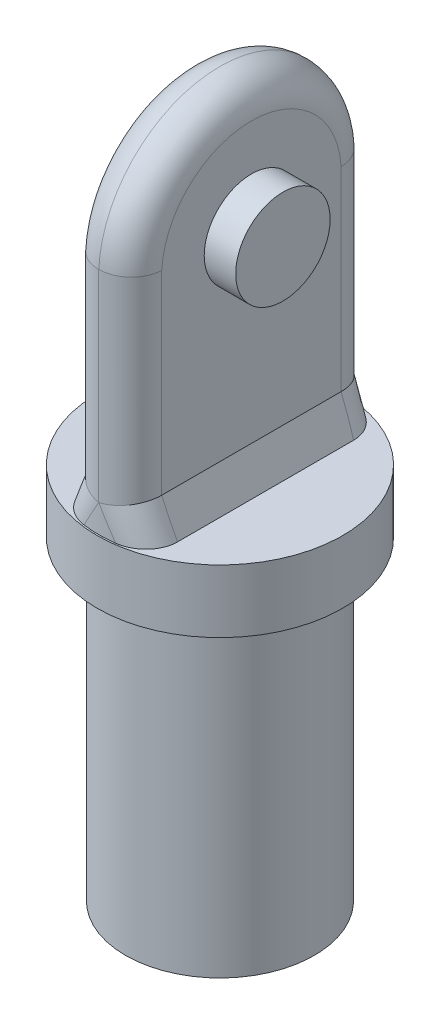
ISO-10303-21;
HEADER;
FILE_DESCRIPTION(('STEP AP214'),'2;1');
FILE_NAME('part.step','',(''),(''),'','','');
FILE_SCHEMA(('AUTOMOTIVE_DESIGN { 1 0 10303 214 1 1 1 1 }'));
ENDSEC;
DATA;
#1=APPLICATION_CONTEXT('core data for automotive mechanical design processes');
#2=APPLICATION_PROTOCOL_DEFINITION('international standard','automotive_design',2000,#1);
#3=PRODUCT_CONTEXT('',#1,'mechanical');
#4=PRODUCT('Part','Part','',(#3));
#5=PRODUCT_RELATED_PRODUCT_CATEGORY('part','',(#4));
#6=PRODUCT_DEFINITION_FORMATION('','',#4);
#7=PRODUCT_DEFINITION_CONTEXT('part definition',#1,'design');
#8=PRODUCT_DEFINITION('design','',#6,#7);
#9=PRODUCT_DEFINITION_SHAPE('','',#8);
#10=(LENGTH_UNIT() NAMED_UNIT(*) SI_UNIT(.MILLI.,.METRE.));
#11=(NAMED_UNIT(*) PLANE_ANGLE_UNIT() SI_UNIT($,.RADIAN.));
#12=(NAMED_UNIT(*) SI_UNIT($,.STERADIAN.) SOLID_ANGLE_UNIT());
#13=UNCERTAINTY_MEASURE_WITH_UNIT(LENGTH_MEASURE(1.E-05),#10,'distance_accuracy_value','');
#14=(GEOMETRIC_REPRESENTATION_CONTEXT(3) GLOBAL_UNCERTAINTY_ASSIGNED_CONTEXT((#13)) GLOBAL_UNIT_ASSIGNED_CONTEXT((#10,
#11,#12)) REPRESENTATION_CONTEXT('',''));
#15=CARTESIAN_POINT('',(0.,0.,0.));
#16=DIRECTION('',(0.,0.,1.));
#17=DIRECTION('',(1.,0.,0.));
#18=AXIS2_PLACEMENT_3D('',#15,#16,#17);
#19=CARTESIAN_POINT('',(0.,2.,0.));
#20=DIRECTION('',(0.,1.,0.));
#21=DIRECTION('',(0.,0.,1.));
#22=AXIS2_PLACEMENT_3D('',#19,#20,#21);
#23=PLANE('',#22);
#24=CARTESIAN_POINT('',(0.,2.,0.));
#25=DIRECTION('',(0.,1.,0.));
#26=DIRECTION('',(0.,0.,1.));
#27=AXIS2_PLACEMENT_3D('',#24,#25,#26);
#28=CIRCLE('',#27,3.9);
#29=CARTESIAN_POINT('',(0.,2.,3.9));
#30=VERTEX_POINT('',#29);
#31=EDGE_CURVE('E500',#30,#30,#28,.T.);
#32=ORIENTED_EDGE('',*,*,#31,.T.);
#33=EDGE_LOOP('',(#32));
#34=FACE_BOUND('',#33,.T.);
#35=DIRECTION('',(0.,0.,1.));
#36=VECTOR('',#35,1.);
#37=CARTESIAN_POINT('',(-1.45,2.,-3.56601521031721));
#38=LINE('',#37,#36);
#39=CARTESIAN_POINT('',(-1.45,2.,-2.7989283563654));
#40=VERTEX_POINT('',#39);
#41=CARTESIAN_POINT('',(-1.45,2.,2.7989283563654));
#42=VERTEX_POINT('',#41);
#43=EDGE_CURVE('E482',#40,#42,#38,.T.);
#44=ORIENTED_EDGE('',*,*,#43,.F.);
#45=CARTESIAN_POINT('',(-2.22662929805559,0.125377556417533,-2.54974328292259));
#46=CARTESIAN_POINT('',(-2.26658035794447,0.0289439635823,-3.24630135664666));
#47=CARTESIAN_POINT('',(-1.66735306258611,-0.257362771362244,-3.48091545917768));
#48=CARTESIAN_POINT('',(-2.19040378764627,0.212818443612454,-2.56392657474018));
#49=CARTESIAN_POINT('',(-2.23035484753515,0.116384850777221,-3.26048464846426));
#50=CARTESIAN_POINT('',(-1.63112755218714,-0.169921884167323,-3.49509875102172));
#51=CARTESIAN_POINT('',(-2.15417827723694,0.300259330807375,-2.57810986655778));
#52=CARTESIAN_POINT('',(-2.19412933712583,0.203825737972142,-3.27466794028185));
#53=CARTESIAN_POINT('',(-1.59490204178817,-0.0824809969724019,-3.50928204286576));
#54=CARTESIAN_POINT('',(-2.0817272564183,0.475141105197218,-2.60647645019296));
#55=CARTESIAN_POINT('',(-2.12167831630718,0.378707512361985,-3.30303452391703));
#56=CARTESIAN_POINT('',(-1.52245102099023,0.0924007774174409,-3.53764862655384));
#57=CARTESIAN_POINT('',(-2.04550174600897,0.562581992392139,-2.62065974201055));
#58=CARTESIAN_POINT('',(-2.08545280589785,0.466148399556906,-3.31721781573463));
#59=CARTESIAN_POINT('',(-1.48622551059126,0.179841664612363,-3.55183191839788));
#60=CARTESIAN_POINT('',(-2.00927623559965,0.65002287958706,-2.63484303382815));
#61=CARTESIAN_POINT('',(-2.04922729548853,0.553589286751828,-3.33140110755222));
#62=CARTESIAN_POINT('',(-1.45000000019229,0.267282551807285,-3.56601521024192));
#63=CARTESIAN_POINT('',(-1.97537480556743,0.731853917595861,-2.64811115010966));
#64=CARTESIAN_POINT('',(-2.01437602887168,0.637713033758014,-3.35260037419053));
#65=CARTESIAN_POINT('',(-1.40594647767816,0.349113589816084,-3.58325289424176));
#66=CARTESIAN_POINT('',(-1.94143829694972,0.813769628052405,-2.66076391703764));
#67=CARTESIAN_POINT('',(-1.97959495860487,0.721667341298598,-3.37304929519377));
#68=CARTESIAN_POINT('',(-1.36196726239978,0.431029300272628,-3.59965139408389));
#69=CARTESIAN_POINT('',(-1.87350289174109,0.977751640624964,-2.68486834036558));
#70=CARTESIAN_POINT('',(-1.90994112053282,0.889797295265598,-3.41278678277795));
#71=CARTESIAN_POINT('',(-1.27397364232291,0.595011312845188,-3.630874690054));
#72=CARTESIAN_POINT('',(-1.83950399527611,1.05981794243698,-2.69631999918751));
#73=CARTESIAN_POINT('',(-1.87506571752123,0.97397930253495,-3.43206820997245));
#74=CARTESIAN_POINT('',(-1.22995923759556,0.677077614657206,-3.64569948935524));
#75=CARTESIAN_POINT('',(-1.7714494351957,1.22408757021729,-2.71805249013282));
#76=CARTESIAN_POINT('',(-1.80520794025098,1.14260152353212,-3.46966586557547));
#77=CARTESIAN_POINT('',(-1.14170864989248,0.84134724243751,-3.67388095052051));
#78=CARTESIAN_POINT('',(-1.73739376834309,1.30629090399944,-2.72833325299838));
#79=CARTESIAN_POINT('',(-1.77021786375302,1.22706032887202,-3.48797867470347));
#80=CARTESIAN_POINT('',(-1.09747245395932,0.923550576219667,-3.6872375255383));
#81=CARTESIAN_POINT('',(-1.66923335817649,1.47081603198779,-2.74771947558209));
#82=CARTESIAN_POINT('',(-1.70012185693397,1.39625758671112,-3.52380772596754));
#83=CARTESIAN_POINT('',(-1.00858458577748,1.08807570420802,-3.71251887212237));
#84=CARTESIAN_POINT('',(-1.63512861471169,1.553137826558,-2.75682493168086));
#85=CARTESIAN_POINT('',(-1.6650024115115,1.48102866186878,-3.54132428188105));
#86=CARTESIAN_POINT('',(-0.963932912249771,1.17039749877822,-3.72444363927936));
#87=CARTESIAN_POINT('',(-1.56700186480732,1.71758170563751,-2.77380474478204));
#88=CARTESIAN_POINT('',(-1.59475763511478,1.65058501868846,-3.57566122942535));
#89=CARTESIAN_POINT('',(-0.874181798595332,1.33484137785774,-3.74681429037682));
#90=CARTESIAN_POINT('',(-1.53298002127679,1.79970339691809,-2.78168354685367));
#91=CARTESIAN_POINT('',(-1.55961200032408,1.73541930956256,-3.59248842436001));
#92=CARTESIAN_POINT('',(-0.829084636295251,1.41696306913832,-3.75726550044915));
#93=CARTESIAN_POINT('',(-1.46489766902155,1.96404010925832,-2.79618887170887));
#94=CARTESIAN_POINT('',(-1.48915538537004,1.90548700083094,-3.62577471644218));
#95=CARTESIAN_POINT('',(-0.737929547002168,1.58129978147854,-3.77668396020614));
#96=CARTESIAN_POINT('',(-1.4308371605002,2.0462551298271,-2.80281540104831));
#97=CARTESIAN_POINT('',(-1.45381324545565,1.9907956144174,-3.64224451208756));
#98=CARTESIAN_POINT('',(-0.69187162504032,1.66351480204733,-3.78565121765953));
#99=CARTESIAN_POINT('',(-1.32860563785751,2.29302087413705,-2.82074643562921));
#100=CARTESIAN_POINT('',(-1.34708246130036,2.24842164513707,-3.69062037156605));
#101=CARTESIAN_POINT('',(-0.553157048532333,1.91028054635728,-3.80998274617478));
#102=CARTESIAN_POINT('',(-1.26038252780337,2.45769734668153,-2.83010291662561));
#103=CARTESIAN_POINT('',(-1.27592600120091,2.42017861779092,-3.72101448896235));
#104=CARTESIAN_POINT('',(-0.45995677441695,2.07495701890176,-3.82277748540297));
#105=CARTESIAN_POINT('',(-1.14885583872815,2.7268996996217,-2.84111718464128));
#106=CARTESIAN_POINT('',(-1.15978317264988,2.70052337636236,-3.76733064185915));
#107=CARTESIAN_POINT('',(-0.307331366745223,2.34415937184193,-3.83785131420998));
#108=CARTESIAN_POINT('',(-1.10557365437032,2.83137393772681,-2.84433944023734));
#109=CARTESIAN_POINT('',(-1.11444016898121,2.80997200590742,-3.78457351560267));
#110=CARTESIAN_POINT('',(-0.24803346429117,2.44863360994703,-3.84226533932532));
#111=CARTESIAN_POINT('',(-1.04063873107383,2.98811340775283,-2.84761604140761));
#112=CARTESIAN_POINT('',(-1.04654715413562,2.97385169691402,-3.80903841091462));
#113=CARTESIAN_POINT('',(-0.15921245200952,2.60537307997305,-3.84674738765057));
#114=CARTESIAN_POINT('',(-1.01899158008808,3.04036515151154,-2.84844877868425));
#115=CARTESIAN_POINT('',(-1.02381528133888,3.02872173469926,-3.81699898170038));
#116=CARTESIAN_POINT('',(-0.129626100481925,2.65762482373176,-3.84788490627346));
#117=CARTESIAN_POINT('',(-0.975695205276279,3.14487364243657,-2.84960085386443));
#118=CARTESIAN_POINT('',(-0.978317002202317,3.13854516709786,-3.83243850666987));
#119=CARTESIAN_POINT('',(-0.0705554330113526,2.76213331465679,-3.84945686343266));
#120=CARTESIAN_POINT('',(-0.954045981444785,3.19713038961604,-2.84992019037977));
#121=CARTESIAN_POINT('',(-0.955550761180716,3.19349816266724,-3.83991386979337));
#122=CARTESIAN_POINT('',(-0.0410711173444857,2.81439006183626,-3.8498913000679));
#123=CARTESIAN_POINT('',(-0.910745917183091,3.30164778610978,-2.85005360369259));
#124=CARTESIAN_POINT('',(-0.909973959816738,3.30351113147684,-3.85444698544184));
#125=CARTESIAN_POINT('',(0.0178517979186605,2.91890745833,-3.8500730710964));
#126=CARTESIAN_POINT('',(-0.889095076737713,3.3539084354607,-2.84986764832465));
#127=CARTESIAN_POINT('',(-0.88716233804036,3.35857366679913,-3.86150191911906));
#128=CARTESIAN_POINT('',(0.0472903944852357,2.97116810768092,-3.84982036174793));
#129=CARTESIAN_POINT('',(-0.845795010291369,3.45842583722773,-2.84898457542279));
#130=CARTESIAN_POINT('',(-0.841471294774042,3.46886239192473,-3.87536908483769));
#131=CARTESIAN_POINT('',(0.106304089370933,3.07568550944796,-3.84861621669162));
#132=CARTESIAN_POINT('',(-0.824145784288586,3.51068258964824,-2.84828745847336));
#133=CARTESIAN_POINT('',(-0.818586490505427,3.52410157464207,-3.88218098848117));
#134=CARTESIAN_POINT('',(0.13587918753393,3.12794226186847,-3.84766478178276));
#135=CARTESIAN_POINT('',(-0.759203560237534,3.66743968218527,-2.8454192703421));
#136=CARTESIAN_POINT('',(-0.749580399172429,3.69066800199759,-3.90221774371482));
#137=CARTESIAN_POINT('',(0.224674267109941,3.28469935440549,-3.84374334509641));
#138=CARTESIAN_POINT('',(-0.71591516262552,3.77192891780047,-2.84247136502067));
#139=CARTESIAN_POINT('',(-0.703613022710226,3.80162373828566,-3.91488120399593));
#140=CARTESIAN_POINT('',(0.283965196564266,3.38918859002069,-3.83970621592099));
#141=CARTESIAN_POINT('',(-0.629162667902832,3.98133149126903,-2.83445727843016));
#142=CARTESIAN_POINT('',(-0.611252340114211,4.0245633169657,-3.93879887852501));
#143=CARTESIAN_POINT('',(0.402717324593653,3.59859116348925,-3.82873596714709));
#144=CARTESIAN_POINT('',(-0.585698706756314,4.08624450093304,-2.82938115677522));
#145=CARTESIAN_POINT('',(-0.564843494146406,4.13658466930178,-3.95002473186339));
#146=CARTESIAN_POINT('',(0.46217800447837,3.70350417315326,-3.82178925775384));
#147=CARTESIAN_POINT('',(-0.498813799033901,4.29596669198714,-2.81711177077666));
#148=CARTESIAN_POINT('',(-0.471843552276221,4.36106728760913,-3.97077515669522));
#149=CARTESIAN_POINT('',(0.580684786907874,3.91322636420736,-3.80505424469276));
#150=CARTESIAN_POINT('',(-0.455392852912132,4.40077587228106,-2.8099184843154));
#151=CARTESIAN_POINT('',(-0.425247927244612,4.47353948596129,-3.98027100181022));
#152=CARTESIAN_POINT('',(0.639730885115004,4.01803554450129,-3.79526591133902));
#153=CARTESIAN_POINT('',(-0.390307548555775,4.55787833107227,-2.79756008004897));
#154=CARTESIAN_POINT('',(-0.355561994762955,4.64174690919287,-3.99294103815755));
#155=CARTESIAN_POINT('',(0.727710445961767,4.17513800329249,-3.77856009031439));
#156=CARTESIAN_POINT('',(-0.368620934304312,4.61022533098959,-2.793179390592));
#157=CARTESIAN_POINT('',(-0.332223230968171,4.69808185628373,-3.99692182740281));
#158=CARTESIAN_POINT('',(0.756937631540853,4.22748500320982,-3.77265451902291));
#159=CARTESIAN_POINT('',(-0.325263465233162,4.71488129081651,-2.7839114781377));
#160=CARTESIAN_POINT('',(-0.285560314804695,4.81071648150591,-4.00413740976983));
#161=CARTESIAN_POINT('',(0.814976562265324,4.33214096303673,-3.76024910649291));
#162=CARTESIAN_POINT('',(-0.303592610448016,4.76719025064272,-2.77902425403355));
#163=CARTESIAN_POINT('',(-0.26224455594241,4.86699589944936,-4.0073646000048));
#164=CARTESIAN_POINT('',(0.843788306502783,4.38444992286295,-3.75374926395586));
#165=CARTESIAN_POINT('',(-0.260268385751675,4.87176596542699,-2.76875996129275));
#166=CARTESIAN_POINT('',(-0.215603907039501,4.97957677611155,-4.01322965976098));
#167=CARTESIAN_POINT('',(0.901133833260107,4.48902563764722,-3.74016273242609));
#168=CARTESIAN_POINT('',(-0.23861501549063,4.92403272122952,-2.76338290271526));
#169=CARTESIAN_POINT('',(-0.192283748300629,5.03586681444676,-4.01586204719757));
#170=CARTESIAN_POINT('',(0.929667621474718,4.54129239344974,-3.73307605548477));
#171=CARTESIAN_POINT('',(-0.195326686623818,5.02852179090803,-2.75214820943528));
#172=CARTESIAN_POINT('',(-0.145628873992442,5.1484820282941,-4.02059558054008));
#173=CARTESIAN_POINT('',(0.98650622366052,4.64578146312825,-3.71832452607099));
#174=CARTESIAN_POINT('',(-0.173691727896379,5.08074410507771,-2.74629057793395));
#175=CARTESIAN_POINT('',(-0.122297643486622,5.204798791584,-4.0226919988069));
#176=CARTESIAN_POINT('',(1.01481103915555,4.69800377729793,-3.71065967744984));
#177=CARTESIAN_POINT('',(-0.152066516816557,5.1329428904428,-2.74019730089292));
#178=CARTESIAN_POINT('',(-0.0990473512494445,5.26092018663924,-4.02454652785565));
#179=CARTESIAN_POINT('',(1.04302575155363,4.75020256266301,-3.70271008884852));
#180=(BOUNDED_SURFACE() B_SPLINE_SURFACE(3,2,((#45,#46,#47),(#48,#49,#50),(#51,#52,#53),(#54,
#55,#56),(#57,#58,#59),(#60,#61,#62),(#63,#64,#65),(#66,#67,#68),(#69,#70,#71),(#72,#73,#74),
(#75,#76,#77),(#78,#79,#80),(#81,#82,#83),(#84,#85,#86),(#87,#88,#89),(#90,#91,#92),(#93,#94,
#95),(#96,#97,#98),(#99,#100,#101),(#102,#103,#104),(#105,#106,#107),(#108,#109,#110),(#111,
#112,#113),(#114,#115,#116),(#117,#118,#119),(#120,#121,#122),(#123,#124,#125),(#126,#127,#128),
(#129,#130,#131),(#132,#133,#134),(#135,#136,#137),(#138,#139,#140),(#141,#142,#143),(#144,#145,
#146),(#147,#148,#149),(#150,#151,#152),(#153,#154,#155),(#156,#157,#158),(#159,#160,#161),
(#162,#163,#164),(#165,#166,#167),(#168,#169,#170),(#171,#172,#173),(#174,#175,#176),(#177,#178,
#179)),.UNSPECIFIED.,.F.,.F.,.F.) B_SPLINE_SURFACE_WITH_KNOTS((4,2,3,2,2,2,2,2,2,2,2,2,2,2,2,2,
2,2,2,2,2,4),(3,3),(0.,0.287113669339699,0.574227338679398,0.842915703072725,1.11160352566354,
1.38030723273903,1.649011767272,1.91671871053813,2.18442425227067,2.71981881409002,
3.05919376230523,3.22888492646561,3.39857654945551,3.56827897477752,3.73798120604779,
4.07737897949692,4.4183799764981,4.75938453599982,4.92987420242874,5.10036424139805,
5.2708507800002,5.44133618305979),(0.,1.),
.UNSPECIFIED.) GEOMETRIC_REPRESENTATION_ITEM() RATIONAL_B_SPLINE_SURFACE(((1.,0.817563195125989,
1.),(1.,0.817563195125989,1.),(1.,0.817563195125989,1.),(1.,0.817563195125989,1.),(1.,
0.817563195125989,1.),(1.,0.817563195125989,1.),(1.,0.814694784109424,1.),(1.,0.811842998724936,
1.),(1.,0.806116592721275,1.),(1.,0.803241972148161,1.),(1.,0.797413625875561,1.),(1.,
0.794459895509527,1.),(1.,0.788410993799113,1.),(1.,0.785315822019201,1.),(1.,0.778930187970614,
1.),(1.,0.775640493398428,1.),(1.,0.768738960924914,1.),(1.,0.765127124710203,1.),(1.,
0.754061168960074,1.),(1.,0.746376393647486,1.),(1.,0.733523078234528,1.),(1.,0.728463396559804,
1.),(1.,0.720836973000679,1.),(1.,0.718288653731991,1.),(1.,0.713198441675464,1.),(1.,
0.71065654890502,1.),(1.,0.705560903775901,1.),(1.,0.703007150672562,1.),(1.,0.697825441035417,
1.),(1.,0.695197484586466,1.),(1.,0.687242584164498,1.),(1.,0.68184450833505,1.),(1.,
0.670917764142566,1.),(1.,0.665388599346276,1.),(1.,0.654320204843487,1.),(1.,0.648780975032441,
1.),(1.,0.640561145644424,1.),(1.,0.637836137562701,1.),(1.,0.632497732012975,1.),(1.,
0.629884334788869,1.),(1.,0.624721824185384,1.),(1.,0.622172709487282,1.),(1.,0.617122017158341,
1.),(1.,0.61462043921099,1.),(1.,0.612134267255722,1.))) REPRESENTATION_ITEM('') SURFACE());
#181=CARTESIAN_POINT('',(-1.45,2.,-2.7989283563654));
#182=CARTESIAN_POINT('',(-1.45000090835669,2.,-2.82617579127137));
#183=CARTESIAN_POINT('',(-1.44880043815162,2.,-2.85340810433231));
#184=CARTESIAN_POINT('',(-1.44403702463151,2.,-2.90765660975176));
#185=CARTESIAN_POINT('',(-1.44047486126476,2.,-2.93467287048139));
#186=CARTESIAN_POINT('',(-1.42634359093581,2.,-3.01492687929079));
#187=CARTESIAN_POINT('',(-1.41232898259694,2.,-3.06759521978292));
#188=CARTESIAN_POINT('',(-1.3757791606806,2.,-3.16978711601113));
#189=CARTESIAN_POINT('',(-1.35325114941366,2.,-3.21931328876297));
#190=CARTESIAN_POINT('',(-1.30054670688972,2.,-3.31413667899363));
#191=CARTESIAN_POINT('',(-1.27036592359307,2.,-3.35943147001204));
#192=CARTESIAN_POINT('',(-1.20186475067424,2.,-3.44671105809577));
#193=CARTESIAN_POINT('',(-1.16324029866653,2.,-3.48845668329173));
#194=CARTESIAN_POINT('',(-1.07994411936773,2.,-3.56541667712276));
#195=CARTESIAN_POINT('',(-1.03526936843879,2.,-3.60062775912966));
#196=CARTESIAN_POINT('',(-0.937690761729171,2.,-3.66616230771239));
#197=CARTESIAN_POINT('',(-0.884425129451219,2.,-3.69594641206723));
#198=CARTESIAN_POINT('',(-0.773869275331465,2.,-3.74666381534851));
#199=CARTESIAN_POINT('',(-0.716582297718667,2.,-3.76760415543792));
#200=CARTESIAN_POINT('',(-0.632483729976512,2.,-3.79106235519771));
#201=CARTESIAN_POINT('',(-0.606664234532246,2.,-3.79731591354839));
#202=CARTESIAN_POINT('',(-0.554708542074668,2.,-3.80803264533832));
#203=CARTESIAN_POINT('',(-0.528573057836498,2.,-3.8124992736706));
#204=CARTESIAN_POINT('',(-0.502305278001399,2.,-3.81607247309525));
#205=B_SPLINE_CURVE_WITH_KNOTS('',3,(#181,#182,#183,#184,#185,#186,#187,#188,#189,#190,#191,
#192,#193,#194,#195,#196,#197,#198,#199,#200,#201,#202,#203,#204),.UNSPECIFIED.,.F.,.F.,(4,2,2,
2,2,2,2,2,2,2,2,4),(0.,0.0816870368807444,0.163347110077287,0.326000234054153,0.488516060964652,
0.651124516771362,0.821017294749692,0.990995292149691,1.17329553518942,1.35545036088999,
1.43509731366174,1.51458952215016),.UNSPECIFIED.);
#206=CARTESIAN_POINT('',(-0.502305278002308,2.,-3.81607247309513));
#207=VERTEX_POINT('',#206);
#208=EDGE_CURVE('E45',#40,#207,#205,.T.);
#209=ORIENTED_EDGE('',*,*,#208,.T.);
#210=CARTESIAN_POINT('',(1.45,2.,-3.56601521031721));
#211=CARTESIAN_POINT('',(1.21530435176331,2.,-3.65790506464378));
#212=CARTESIAN_POINT('',(0.721170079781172,2.,-3.80419717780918));
#213=CARTESIAN_POINT('',(0.,2.,-3.87290141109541));
#214=CARTESIAN_POINT('',(-0.721170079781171,2.,-3.80419717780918));
#215=CARTESIAN_POINT('',(-1.21530435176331,2.,-3.65790506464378));
#216=CARTESIAN_POINT('',(-1.45,2.,-3.56601521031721));
#217=B_SPLINE_CURVE_WITH_KNOTS('',3,(#210,#211,#212,#213,#214,#215,#216),.UNSPECIFIED.,.F.,.F.,
(4,1,1,1,4),(0.0105903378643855,0.255295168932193,0.5,0.744704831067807,0.989409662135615),.UNSPECIFIED.);
#218=CARTESIAN_POINT('',(0.502305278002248,2.,-3.81607247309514));
#219=VERTEX_POINT('',#218);
#220=EDGE_CURVE('E444',#219,#207,#217,.T.);
#221=ORIENTED_EDGE('',*,*,#220,.F.);
#222=CARTESIAN_POINT('',(1.66735306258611,-0.257362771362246,-3.48091545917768));
#223=CARTESIAN_POINT('',(2.26658035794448,0.028943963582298,-3.24630135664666));
#224=CARTESIAN_POINT('',(2.22662929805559,0.125377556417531,-2.54974328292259));
#225=CARTESIAN_POINT('',(1.63112755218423,-0.169921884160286,-3.49509875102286));
#226=CARTESIAN_POINT('',(2.23035484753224,0.116384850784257,-3.26048464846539));
#227=CARTESIAN_POINT('',(2.19040378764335,0.21281844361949,-2.56392657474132));
#228=CARTESIAN_POINT('',(1.59490204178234,-0.0824809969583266,-3.50928204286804));
#229=CARTESIAN_POINT('',(2.19412933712,0.203825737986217,-3.27466794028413));
#230=CARTESIAN_POINT('',(2.15417827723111,0.30025933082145,-2.57810986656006));
#231=CARTESIAN_POINT('',(1.52245102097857,0.0924007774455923,-3.53764862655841));
#232=CARTESIAN_POINT('',(2.12167831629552,0.378707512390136,-3.3030345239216));
#233=CARTESIAN_POINT('',(2.08172725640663,0.475141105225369,-2.60647645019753));
#234=CARTESIAN_POINT('',(1.48622551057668,0.179841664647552,-3.55183191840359));
#235=CARTESIAN_POINT('',(2.08545280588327,0.466148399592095,-3.31721781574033));
#236=CARTESIAN_POINT('',(2.04550174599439,0.562581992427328,-2.62065974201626));
#237=CARTESIAN_POINT('',(1.4500000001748,0.267282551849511,-3.56601521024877));
#238=CARTESIAN_POINT('',(2.04922729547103,0.553589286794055,-3.33140110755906));
#239=CARTESIAN_POINT('',(2.00927623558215,0.650022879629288,-2.63484303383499));
#240=CARTESIAN_POINT('',(1.40594647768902,0.349113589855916,-3.58325289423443));
#241=CARTESIAN_POINT('',(2.01437602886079,0.637713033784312,-3.35260037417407));
#242=CARTESIAN_POINT('',(1.97537480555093,0.731853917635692,-2.64811115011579));
#243=CARTESIAN_POINT('',(1.36196726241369,0.43102930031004,-3.59965139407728));
#244=CARTESIAN_POINT('',(1.97959495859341,0.72166734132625,-3.3730492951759));
#245=CARTESIAN_POINT('',(1.94143829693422,0.813769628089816,-2.66076391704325));
#246=CARTESIAN_POINT('',(1.27397364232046,0.595011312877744,-3.63087469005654));
#247=CARTESIAN_POINT('',(1.90994112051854,0.889797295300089,-3.41278678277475));
#248=CARTESIAN_POINT('',(1.8735028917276,0.977751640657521,-2.68486834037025));
#249=CARTESIAN_POINT('',(1.22995923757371,0.677077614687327,-3.64569948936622));
#250=CARTESIAN_POINT('',(1.8750657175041,0.973979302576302,-3.43206820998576));
#251=CARTESIAN_POINT('',(1.83950399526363,1.0598179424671,-2.69631999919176));
#252=CARTESIAN_POINT('',(1.14170864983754,0.841347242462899,-3.67388095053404));
#253=CARTESIAN_POINT('',(1.80520794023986,1.14260152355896,-3.46966586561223));
#254=CARTESIAN_POINT('',(1.77144943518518,1.22408757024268,-2.71805249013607));
#255=CARTESIAN_POINT('',(1.09747245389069,0.923550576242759,-3.68723752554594));
#256=CARTESIAN_POINT('',(1.77021786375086,1.22706032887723,-3.48797867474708));
#257=CARTESIAN_POINT('',(1.73739376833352,1.30629090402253,-2.72833325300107));
#258=CARTESIAN_POINT('',(1.00858458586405,1.08807570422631,-3.71251887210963));
#259=CARTESIAN_POINT('',(1.70012185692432,1.3962575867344,-3.52380772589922));
#260=CARTESIAN_POINT('',(1.66923335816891,1.47081603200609,-2.74771947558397));
#261=CARTESIAN_POINT('',(0.963932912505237,1.17039749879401,-3.72444363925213));
#262=CARTESIAN_POINT('',(1.66500241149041,1.4810286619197,-3.54132428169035));
#263=CARTESIAN_POINT('',(1.63512861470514,1.55313782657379,-2.7568249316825));
#264=CARTESIAN_POINT('',(0.874181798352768,1.33484137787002,-3.74681429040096));
#265=CARTESIAN_POINT('',(1.59475763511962,1.65058501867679,-3.57566122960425));
#266=CARTESIAN_POINT('',(1.56700186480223,1.71758170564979,-2.77380474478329));
#267=CARTESIAN_POINT('',(0.829084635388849,1.41696306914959,-3.75726550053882));
#268=CARTESIAN_POINT('',(1.55961200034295,1.73541930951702,-3.59248842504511));
#269=CARTESIAN_POINT('',(1.53298002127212,1.79970339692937,-2.78168354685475));
#270=CARTESIAN_POINT('',(0.737929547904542,1.58129978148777,-3.77668396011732));
#271=CARTESIAN_POINT('',(1.48915538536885,1.90548700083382,-3.62577471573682));
#272=CARTESIAN_POINT('',(1.46489766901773,1.96404010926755,-2.79618887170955));
#273=CARTESIAN_POINT('',(0.691871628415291,1.66351480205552,-3.7856512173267));
#274=CARTESIAN_POINT('',(1.45381324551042,1.99079561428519,-3.64224450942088));
#275=CARTESIAN_POINT('',(1.4308371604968,2.0462551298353,-2.80281540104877));
#276=CARTESIAN_POINT('',(0.553157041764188,1.91028054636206,-3.80998274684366));
#277=CARTESIAN_POINT('',(1.3470824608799,2.24842164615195,-3.6906203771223));
#278=CARTESIAN_POINT('',(1.32860563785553,2.29302087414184,-2.82074643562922));
#279=CARTESIAN_POINT('',(0.45995673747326,2.07495701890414,-3.8227774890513));
#280=CARTESIAN_POINT('',(1.27592599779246,2.42017862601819,-3.72101452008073));
#281=CARTESIAN_POINT('',(1.26038252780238,2.45769734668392,-2.83010291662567));
#282=CARTESIAN_POINT('',(0.307331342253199,2.34415937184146,-3.83785131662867));
#283=CARTESIAN_POINT('',(1.15978316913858,2.7005233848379,-3.76733066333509));
#284=CARTESIAN_POINT('',(1.14885583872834,2.72689969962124,-2.84111718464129));
#285=CARTESIAN_POINT('',(0.248033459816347,2.44863360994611,-3.84226533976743));
#286=CARTESIAN_POINT('',(1.11444016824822,2.80997200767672,-3.78457351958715));
#287=CARTESIAN_POINT('',(1.1055736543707,2.83137393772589,-2.8443394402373));
#288=CARTESIAN_POINT('',(0.159212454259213,2.60537307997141,-3.84674738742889));
#289=CARTESIAN_POINT('',(1.04654715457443,2.97385169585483,-3.80903840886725));
#290=CARTESIAN_POINT('',(1.04063873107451,2.98811340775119,-2.84761604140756));
#291=CARTESIAN_POINT('',(0.129626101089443,2.65762482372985,-3.84788490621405));
#292=CARTESIAN_POINT('',(1.02381528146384,3.02872173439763,-3.81699898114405));
#293=CARTESIAN_POINT('',(1.01899158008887,3.04036515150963,-2.84844877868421));
#294=CARTESIAN_POINT('',(0.0705554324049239,2.76213331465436,-3.84945686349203));
#295=CARTESIAN_POINT('',(0.978317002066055,3.13854516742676,-3.83243850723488));
#296=CARTESIAN_POINT('',(0.975695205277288,3.14487364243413,-2.84960085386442));
#297=CARTESIAN_POINT('',(0.0410711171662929,2.81439006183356,-3.84989130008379));
#298=CARTESIAN_POINT('',(0.955550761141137,3.19349816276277,-3.83991386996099));
#299=CARTESIAN_POINT('',(0.954045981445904,3.19713038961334,-2.84992019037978));
#300=CARTESIAN_POINT('',(-0.0178517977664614,2.91890745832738,-3.85007307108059));
#301=CARTESIAN_POINT('',(0.909973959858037,3.30351113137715,-3.85444698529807));
#302=CARTESIAN_POINT('',(0.91074591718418,3.30164778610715,-2.85005360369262));
#303=CARTESIAN_POINT('',(-0.0472903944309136,2.97116810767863,-3.84982036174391));
#304=CARTESIAN_POINT('',(0.887162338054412,3.35857366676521,-3.86150191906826));
#305=CARTESIAN_POINT('',(0.889095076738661,3.3539084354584,-2.84986764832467));
#306=CARTESIAN_POINT('',(-0.106304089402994,3.07568550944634,-3.8486162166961));
#307=CARTESIAN_POINT('',(0.841471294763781,3.46886239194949,-3.87536908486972));
#308=CARTESIAN_POINT('',(0.845795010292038,3.45842583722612,-2.8489845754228));
#309=CARTESIAN_POINT('',(-0.135879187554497,3.12794226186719,-3.84766478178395));
#310=CARTESIAN_POINT('',(0.818586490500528,3.5241015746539,-3.88218098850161));
#311=CARTESIAN_POINT('',(0.824145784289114,3.51068258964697,-2.84828745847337));
#312=CARTESIAN_POINT('',(-0.224674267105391,3.28469935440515,-3.84374334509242));
#313=CARTESIAN_POINT('',(0.749580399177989,3.69066800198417,-3.90221774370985));
#314=CARTESIAN_POINT('',(0.759203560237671,3.66743968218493,-2.84541927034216));
#315=CARTESIAN_POINT('',(-0.283965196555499,3.38918859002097,-3.83970621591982));
#316=CARTESIAN_POINT('',(0.703613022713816,3.801623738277,-3.91488120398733));
#317=CARTESIAN_POINT('',(0.715915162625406,3.77192891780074,-2.84247136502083));
#318=CARTESIAN_POINT('',(-0.402717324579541,3.59859116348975,-3.82873596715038));
#319=CARTESIAN_POINT('',(0.611252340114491,4.02456331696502,-3.93879887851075));
#320=CARTESIAN_POINT('',(0.629162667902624,3.98133149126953,-2.83445727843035));
#321=CARTESIAN_POINT('',(-0.462178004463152,3.70350417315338,-3.82178925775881));
#322=CARTESIAN_POINT('',(0.564843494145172,4.13658466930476,-3.95002473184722));
#323=CARTESIAN_POINT('',(0.585698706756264,4.08624450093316,-2.82938115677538));
#324=CARTESIAN_POINT('',(-0.580684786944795,3.91322636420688,-3.80505424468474));
#325=CARTESIAN_POINT('',(0.47184355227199,4.36106728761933,-3.97077515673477));
#326=CARTESIAN_POINT('',(0.498813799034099,4.29596669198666,-2.81711177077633));
#327=CARTESIAN_POINT('',(-0.639730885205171,4.01803554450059,-3.79526591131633));
#328=CARTESIAN_POINT('',(0.425247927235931,4.47353948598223,-3.98027100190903));
#329=CARTESIAN_POINT('',(0.45539285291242,4.40077587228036,-2.80991848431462));
#330=CARTESIAN_POINT('',(-0.727710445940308,4.1751380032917,-3.77856009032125));
#331=CARTESIAN_POINT('',(0.355561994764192,4.64174690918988,-3.99294103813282));
#332=CARTESIAN_POINT('',(0.390307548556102,4.55787833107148,-2.79756008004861));
#333=CARTESIAN_POINT('',(-0.75693763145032,4.22748500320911,-3.7726545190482));
#334=CARTESIAN_POINT('',(0.332223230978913,4.6980818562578,-3.99692182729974));
#335=CARTESIAN_POINT('',(0.368620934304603,4.61022533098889,-2.79317939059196));
#336=CARTESIAN_POINT('',(-0.814976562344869,4.33214096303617,-3.76024910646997));
#337=CARTESIAN_POINT('',(0.285560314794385,4.8107164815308,-4.00413740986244));
#338=CARTESIAN_POINT('',(0.325263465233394,4.71488129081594,-2.78391147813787));
#339=CARTESIAN_POINT('',(-0.843788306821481,4.38444992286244,-3.75374926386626));
#340=CARTESIAN_POINT('',(0.262244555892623,4.86699589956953,-4.00736460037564));
#341=CARTESIAN_POINT('',(0.303592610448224,4.76719025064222,-2.77902425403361));
#342=CARTESIAN_POINT('',(-0.90113383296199,4.48902563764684,-3.74016273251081));
#343=CARTESIAN_POINT('',(0.215603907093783,4.97957677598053,-4.01322965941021));
#344=CARTESIAN_POINT('',(0.260268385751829,4.87176596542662,-2.76875996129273));
#345=CARTESIAN_POINT('',(-0.929667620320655,4.54129239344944,-3.73307605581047));
#346=CARTESIAN_POINT('',(0.19228374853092,5.03586681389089,-4.01586204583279));
#347=CARTESIAN_POINT('',(0.238615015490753,4.92403272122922,-2.76338290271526));
#348=CARTESIAN_POINT('',(-0.986506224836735,4.6457814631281,-3.71832452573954));
#349=CARTESIAN_POINT('',(0.14562887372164,5.14848202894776,-4.02059558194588));
#350=CARTESIAN_POINT('',(0.195326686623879,5.02852179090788,-2.75214820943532));
#351=CARTESIAN_POINT('',(-1.01481104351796,4.69800377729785,-3.71065967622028));
#352=CARTESIAN_POINT('',(0.122297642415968,5.20479879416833,-4.02269200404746));
#353=CARTESIAN_POINT('',(0.173691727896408,5.08074410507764,-2.74629057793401));
#354=CARTESIAN_POINT('',(-1.04302576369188,4.75020256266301,-3.70271008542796));
#355=CARTESIAN_POINT('',(0.0990473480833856,5.26092019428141,-4.02454654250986));
#356=CARTESIAN_POINT('',(0.152066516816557,5.13294289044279,-2.74019730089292));
#357=(BOUNDED_SURFACE() B_SPLINE_SURFACE(3,2,((#222,#223,#224),(#225,#226,#227),(#228,#229,
#230),(#231,#232,#233),(#234,#235,#236),(#237,#238,#239),(#240,#241,#242),(#243,#244,#245),
(#246,#247,#248),(#249,#250,#251),(#252,#253,#254),(#255,#256,#257),(#258,#259,#260),(#261,#262,
#263),(#264,#265,#266),(#267,#268,#269),(#270,#271,#272),(#273,#274,#275),(#276,#277,#278),
(#279,#280,#281),(#282,#283,#284),(#285,#286,#287),(#288,#289,#290),(#291,#292,#293),(#294,#295,
#296),(#297,#298,#299),(#300,#301,#302),(#303,#304,#305),(#306,#307,#308),(#309,#310,#311),
(#312,#313,#314),(#315,#316,#317),(#318,#319,#320),(#321,#322,#323),(#324,#325,#326),(#327,#328,
#329),(#330,#331,#332),(#333,#334,#335),(#336,#337,#338),(#339,#340,#341),(#342,#343,#344),
(#345,#346,#347),(#348,#349,#350),(#351,#352,#353),(#354,#355,#356)),.UNSPECIFIED.,.F.,.F.,
.F.) B_SPLINE_SURFACE_WITH_KNOTS((4,2,3,2,2,2,2,2,2,2,2,2,2,2,2,2,2,2,2,2,2,4),(3,3),(0.,
0.287113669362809,0.574227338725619,0.842915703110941,1.11160352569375,1.38030723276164,
1.64901176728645,1.91671871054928,2.18442425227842,2.71981881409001,3.05919376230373,
3.22888492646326,3.3985765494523,3.56827897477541,3.73798120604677,4.07737897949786,
4.41837997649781,4.75938453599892,4.92987420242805,5.10036424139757,5.27085077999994,
5.44133618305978),(0.,1.),
.UNSPECIFIED.) GEOMETRIC_REPRESENTATION_ITEM() RATIONAL_B_SPLINE_SURFACE(((1.,0.81756319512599,
1.),(1.,0.81756319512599,1.),(1.,0.81756319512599,1.),(1.,0.81756319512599,1.),(1.,
0.81756319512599,1.),(1.,0.81756319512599,1.),(1.,0.814694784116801,1.),(1.,0.811842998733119,
1.),(1.,0.806116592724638,1.),(1.,0.803241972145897,1.),(1.,0.797413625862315,1.),(1.,
0.794459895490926,1.),(1.,0.78841099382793,1.),(1.,0.785315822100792,1.),(1.,0.778930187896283,
1.),(1.,0.775640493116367,1.),(1.,0.768738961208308,1.),(1.,0.765127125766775,1.),(1.,
0.75406116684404,1.),(1.,0.746376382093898,1.),(1.,0.733523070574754,1.),(1.,0.728463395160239,
1.),(1.,0.720836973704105,1.),(1.,0.718288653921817,1.),(1.,0.71319844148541,1.),(1.,
0.710656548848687,1.),(1.,0.705560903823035,1.),(1.,0.703007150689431,1.),(1.,0.697825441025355,
1.),(1.,0.695197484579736,1.),(1.,0.687242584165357,1.),(1.,0.681844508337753,1.),(1.,
0.670917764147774,1.),(1.,0.66538859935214,1.),(1.,0.654320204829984,1.),(1.,0.648780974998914,
1.),(1.,0.640561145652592,1.),(1.,0.637836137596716,1.),(1.,0.632497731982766,1.),(1.,
0.629884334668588,1.),(1.,0.624721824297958,1.),(1.,0.622172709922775,1.),(1.,0.617122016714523,
1.),(1.,0.614620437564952,1.),(1.,0.61213426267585,1.))) REPRESENTATION_ITEM('') SURFACE());
#358=CARTESIAN_POINT('',(0.502305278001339,1.99999999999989,-3.81607247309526));
#359=CARTESIAN_POINT('',(0.566258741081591,1.99999999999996,-3.80740958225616));
#360=CARTESIAN_POINT('',(0.62949093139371,1.99999999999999,-3.79336502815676));
#361=CARTESIAN_POINT('',(0.752857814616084,2.00000000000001,-3.75495234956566));
#362=CARTESIAN_POINT('',(0.812986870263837,2.,-3.73056613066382));
#363=CARTESIAN_POINT('',(0.928314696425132,2.,-3.67191345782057));
#364=CARTESIAN_POINT('',(0.983508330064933,2.,-3.63763686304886));
#365=CARTESIAN_POINT('',(1.08704782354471,2.,-3.56000206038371));
#366=CARTESIAN_POINT('',(1.13539932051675,2.,-3.51665140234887));
#367=CARTESIAN_POINT('',(1.22190406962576,2.,-3.42361089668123));
#368=CARTESIAN_POINT('',(1.26036099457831,2.,-3.37420431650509));
#369=CARTESIAN_POINT('',(1.32766547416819,2.,-3.26925488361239));
#370=CARTESIAN_POINT('',(1.35651990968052,2.,-3.21371646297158));
#371=CARTESIAN_POINT('',(1.40268862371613,2.,-3.09947456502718));
#372=CARTESIAN_POINT('',(1.42025619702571,2.,-3.04087502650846));
#373=CARTESIAN_POINT('',(1.43800539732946,2.,-2.95120758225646));
#374=CARTESIAN_POINT('',(1.44248846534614,2.,-2.92094068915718));
#375=CARTESIAN_POINT('',(1.44848733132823,2.,-2.86009916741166));
#376=CARTESIAN_POINT('',(1.45000160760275,2.,-2.82952438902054));
#377=CARTESIAN_POINT('',(1.45000000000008,2.,-2.79892835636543));
#378=B_SPLINE_CURVE_WITH_KNOTS('',3,(#358,#359,#360,#361,#362,#363,#364,#365,#366,#367,#368,
#369,#370,#371,#372,#373,#374,#375,#376,#377),.UNSPECIFIED.,.F.,.F.,(4,2,2,2,2,2,2,2,2,4),(0.,
0.193407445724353,0.38715469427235,0.581101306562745,0.774887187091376,0.96171984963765,
1.14841834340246,1.33076540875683,1.42242890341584,1.5141393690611),.UNSPECIFIED.);
#379=CARTESIAN_POINT('',(1.45,2.,-2.7989283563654));
#380=VERTEX_POINT('',#379);
#381=EDGE_CURVE('E158',#219,#380,#378,.T.);
#382=ORIENTED_EDGE('',*,*,#381,.T.);
#383=DIRECTION('',(0.,0.,-1.));
#384=VECTOR('',#383,1.);
#385=CARTESIAN_POINT('',(1.45,2.,-3.56601521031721));
#386=LINE('',#385,#384);
#387=CARTESIAN_POINT('',(1.45,2.,2.7989283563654));
#388=VERTEX_POINT('',#387);
#389=EDGE_CURVE('E490',#388,#380,#386,.T.);
#390=ORIENTED_EDGE('',*,*,#389,.F.);
#391=CARTESIAN_POINT('',(2.2266292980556,0.125377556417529,2.54974328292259));
#392=CARTESIAN_POINT('',(2.26658035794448,0.0289439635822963,3.24630135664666));
#393=CARTESIAN_POINT('',(1.66735306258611,-0.257362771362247,3.48091545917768));
#394=CARTESIAN_POINT('',(2.19040378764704,0.212818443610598,2.56392657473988));
#395=CARTESIAN_POINT('',(2.23035484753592,0.116384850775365,3.26048464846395));
#396=CARTESIAN_POINT('',(1.63112755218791,-0.169921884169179,3.49509875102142));
#397=CARTESIAN_POINT('',(2.15417827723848,0.300259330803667,2.57810986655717));
#398=CARTESIAN_POINT('',(2.19412933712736,0.203825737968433,3.27466794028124));
#399=CARTESIAN_POINT('',(1.59490204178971,-0.0824809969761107,3.50928204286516));
#400=CARTESIAN_POINT('',(2.08172725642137,0.475141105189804,2.60647645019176));
#401=CARTESIAN_POINT('',(2.12167831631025,0.37870751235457,3.30303452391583));
#402=CARTESIAN_POINT('',(1.5224510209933,0.0924007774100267,3.53764862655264));
#403=CARTESIAN_POINT('',(2.04550174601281,0.562581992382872,2.62065974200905));
#404=CARTESIAN_POINT('',(2.08545280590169,0.466148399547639,3.31721781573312));
#405=CARTESIAN_POINT('',(1.4862255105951,0.179841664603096,3.55183191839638));
#406=CARTESIAN_POINT('',(2.00927623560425,0.650022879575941,2.63484303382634));
#407=CARTESIAN_POINT('',(2.04922729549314,0.553589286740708,3.33140110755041));
#408=CARTESIAN_POINT('',(1.4500000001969,0.267282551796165,3.56601521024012));
#409=CARTESIAN_POINT('',(1.97537480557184,0.731853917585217,2.64811115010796));
#410=CARTESIAN_POINT('',(2.01437602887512,0.637713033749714,3.35260037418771));
#411=CARTESIAN_POINT('',(1.40594647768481,0.34911358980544,3.58325289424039));
#412=CARTESIAN_POINT('',(1.94143829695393,0.813769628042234,2.66076391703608));
#413=CARTESIAN_POINT('',(1.9795949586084,0.721667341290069,3.37304929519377));
#414=CARTESIAN_POINT('',(1.36196726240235,0.431029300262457,3.59965139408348));
#415=CARTESIAN_POINT('',(1.87350289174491,0.977751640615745,2.68486834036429));
#416=CARTESIAN_POINT('',(1.90994112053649,0.889797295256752,3.41278678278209));
#417=CARTESIAN_POINT('',(1.27397364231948,0.595011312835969,3.63087469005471));
#418=CARTESIAN_POINT('',(1.83950399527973,1.05981794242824,2.69631999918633));
#419=CARTESIAN_POINT('',(1.87506571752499,0.973979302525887,3.43206820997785));
#420=CARTESIAN_POINT('',(1.22995923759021,0.677077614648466,3.6456994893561));
#421=CARTESIAN_POINT('',(1.7714494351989,1.22408757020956,2.71805249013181));
#422=CARTESIAN_POINT('',(1.80520794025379,1.14260152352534,3.46966586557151));
#423=CARTESIAN_POINT('',(1.14170864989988,0.841347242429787,3.67388095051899));
#424=CARTESIAN_POINT('',(1.73739376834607,1.30629090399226,2.72833325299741));
#425=CARTESIAN_POINT('',(1.77021786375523,1.22706032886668,3.48797867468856));
#426=CARTESIAN_POINT('',(1.0974724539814,0.92355057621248,3.68723752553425));
#427=CARTESIAN_POINT('',(1.66923335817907,1.47081603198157,2.74771947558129));
#428=CARTESIAN_POINT('',(1.70012185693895,1.39625758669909,3.52380772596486));
#429=CARTESIAN_POINT('',(1.00858458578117,1.08807570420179,3.71251887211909));
#430=CARTESIAN_POINT('',(1.63512861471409,1.5531378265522,2.75682493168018));
#431=CARTESIAN_POINT('',(1.66500241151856,1.48102866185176,3.54132428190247));
#432=CARTESIAN_POINT('',(0.963932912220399,1.17039749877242,3.72444363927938));
#433=CARTESIAN_POINT('',(1.56700186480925,1.71758170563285,2.77380474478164));
#434=CARTESIAN_POINT('',(1.5947576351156,1.65058501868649,3.57566122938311));
#435=CARTESIAN_POINT('',(0.874181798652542,1.33484137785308,3.74681429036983));
#436=CARTESIAN_POINT('',(1.53298002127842,1.79970339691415,2.78168354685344));
#437=CARTESIAN_POINT('',(1.55961200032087,1.7354193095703,3.59248842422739));
#438=CARTESIAN_POINT('',(0.829084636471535,1.41696306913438,3.75726550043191));
#439=CARTESIAN_POINT('',(1.46489766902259,1.96404010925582,2.7961888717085));
#440=CARTESIAN_POINT('',(1.48915538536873,1.9054870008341,3.62577471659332));
#441=CARTESIAN_POINT('',(0.737929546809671,1.58129978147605,3.77668396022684));
#442=CARTESIAN_POINT('',(1.43083716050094,2.04625512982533,2.80281540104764));
#443=CARTESIAN_POINT('',(1.45381324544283,1.99079561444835,3.64224451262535));
#444=CARTESIAN_POINT('',(0.691871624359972,1.66351480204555,3.78565121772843));
#445=CARTESIAN_POINT('',(1.32860563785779,2.29302087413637,2.82074643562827));
#446=CARTESIAN_POINT('',(1.34708246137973,2.24842164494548,3.69062037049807));
#447=CARTESIAN_POINT('',(0.553157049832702,1.9102805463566,3.80998274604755));
#448=CARTESIAN_POINT('',(1.26038252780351,2.45769734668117,2.83010291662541));
#449=CARTESIAN_POINT('',(1.27592600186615,2.42017861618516,3.72101448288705));
#450=CARTESIAN_POINT('',(0.459956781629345,2.0749570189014,3.82277748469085));
#451=CARTESIAN_POINT('',(1.1488558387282,2.72689969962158,2.84111718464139));
#452=CARTESIAN_POINT('',(1.15978317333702,2.70052337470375,3.76733063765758));
#453=CARTESIAN_POINT('',(0.307331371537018,2.3441593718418,3.83785131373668));
#454=CARTESIAN_POINT('',(1.10557365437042,2.83137393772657,2.84433944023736));
#455=CARTESIAN_POINT('',(1.11444016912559,2.80997200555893,3.78457351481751));
#456=CARTESIAN_POINT('',(0.248033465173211,2.4486336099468,3.84226533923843));
#457=CARTESIAN_POINT('',(1.040638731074,2.98811340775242,2.84761604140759));
#458=CARTESIAN_POINT('',(1.04654715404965,2.97385169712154,3.80903841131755));
#459=CARTESIAN_POINT('',(0.159212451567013,2.60537307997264,3.84674738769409));
#460=CARTESIAN_POINT('',(1.01899158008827,3.04036515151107,2.84844877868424));
#461=CARTESIAN_POINT('',(1.02381528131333,3.02872173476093,3.81699898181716));
#462=CARTESIAN_POINT('',(0.12962610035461,2.6576248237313,3.84788490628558));
#463=CARTESIAN_POINT('',(0.975695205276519,3.14487364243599,2.84960085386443));
#464=CARTESIAN_POINT('',(0.978317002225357,3.13854516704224,3.83243850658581));
#465=CARTESIAN_POINT('',(0.0705554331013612,2.76213331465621,3.84945686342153));
#466=CARTESIAN_POINT('',(0.954045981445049,3.1971303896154,2.84992019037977));
#467=CARTESIAN_POINT('',(0.95555076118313,3.19349816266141,3.83991386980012));
#468=CARTESIAN_POINT('',(0.0410711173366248,2.81439006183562,3.84989130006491));
#469=CARTESIAN_POINT('',(0.910745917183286,3.30164778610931,2.85005360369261));
#470=CARTESIAN_POINT('',(0.909973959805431,3.30351113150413,3.85444698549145));
#471=CARTESIAN_POINT('',(-0.0178517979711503,2.91890745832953,3.85007307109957));
#472=CARTESIAN_POINT('',(0.889095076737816,3.35390843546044,2.84986764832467));
#473=CARTESIAN_POINT('',(0.887162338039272,3.35857366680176,3.86150191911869));
#474=CARTESIAN_POINT('',(-0.0472903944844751,2.97116810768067,3.84982036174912));
#475=CARTESIAN_POINT('',(0.845795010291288,3.45842583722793,2.84898457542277));
#476=CARTESIAN_POINT('',(0.841471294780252,3.46886239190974,3.87536908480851));
#477=CARTESIAN_POINT('',(-0.106304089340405,3.07568550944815,3.84861621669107));
#478=CARTESIAN_POINT('',(0.824145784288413,3.51068258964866,2.84828745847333));
#479=CARTESIAN_POINT('',(0.818586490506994,3.52410157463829,3.88218098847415));
#480=CARTESIAN_POINT('',(-0.135879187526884,3.12794226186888,3.84766478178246));
#481=CARTESIAN_POINT('',(0.759203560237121,3.66743968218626,2.84541927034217));
#482=CARTESIAN_POINT('',(0.749580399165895,3.69066800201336,3.90221774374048));
#483=CARTESIAN_POINT('',(-0.224674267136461,3.28469935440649,3.84374334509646));
#484=CARTESIAN_POINT('',(0.715915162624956,3.77192891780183,2.84247136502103));
#485=CARTESIAN_POINT('',(0.703613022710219,3.80162373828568,3.91488120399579));
#486=CARTESIAN_POINT('',(-0.283965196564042,3.38918859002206,3.83970621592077));
#487=CARTESIAN_POINT('',(0.629162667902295,3.98133149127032,2.83445727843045));
#488=CARTESIAN_POINT('',(0.61125234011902,4.02456331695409,3.93879887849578));
#489=CARTESIAN_POINT('',(-0.402717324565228,3.59859116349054,3.82873596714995));
#490=CARTESIAN_POINT('',(0.585698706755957,4.0862445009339,2.82938115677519));
#491=CARTESIAN_POINT('',(0.564843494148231,4.13658466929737,3.95002473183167));
#492=CARTESIAN_POINT('',(-0.462178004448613,3.70350417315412,3.8217892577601));
#493=CARTESIAN_POINT('',(0.498813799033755,4.29596669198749,2.81711177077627));
#494=CARTESIAN_POINT('',(0.471843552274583,4.36106728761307,3.9707751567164));
#495=CARTESIAN_POINT('',(-0.580684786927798,3.91322636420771,3.8050542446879));
#496=CARTESIAN_POINT('',(0.455392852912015,4.40077587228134,2.80991848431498));
#497=CARTESIAN_POINT('',(0.425247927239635,4.47353948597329,3.98027100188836));
#498=CARTESIAN_POINT('',(-0.639730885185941,4.01803554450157,3.79526591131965));
#499=CARTESIAN_POINT('',(0.390307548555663,4.55787833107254,2.79756008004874));
#500=CARTESIAN_POINT('',(0.355561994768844,4.64174690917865,3.99294103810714));
#501=CARTESIAN_POINT('',(-0.727710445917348,4.17513800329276,3.77856009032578));
#502=CARTESIAN_POINT('',(0.368620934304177,4.61022533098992,2.79317939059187));
#503=CARTESIAN_POINT('',(0.332223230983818,4.69808185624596,3.99692182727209));
#504=CARTESIAN_POINT('',(-0.756937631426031,4.22748500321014,3.7726545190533));
#505=CARTESIAN_POINT('',(0.325263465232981,4.71488129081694,2.78391147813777));
#506=CARTESIAN_POINT('',(0.285560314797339,4.81071648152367,4.00413740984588));
#507=CARTESIAN_POINT('',(-0.814976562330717,4.33214096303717,3.76024910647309));
#508=CARTESIAN_POINT('',(0.303592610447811,4.76719025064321,2.77902425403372));
#509=CARTESIAN_POINT('',(0.262244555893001,4.86699589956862,4.00736460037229));
#510=CARTESIAN_POINT('',(-0.843788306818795,4.38444992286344,3.75374926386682));
#511=CARTESIAN_POINT('',(0.260268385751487,4.87176596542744,2.76875996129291));
#512=CARTESIAN_POINT('',(0.21560390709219,4.97957677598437,4.0132296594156));
#513=CARTESIAN_POINT('',(-0.901133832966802,4.48902563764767,3.74016273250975));
#514=CARTESIAN_POINT('',(0.238615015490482,4.92403272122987,2.7633829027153));
#515=CARTESIAN_POINT('',(0.192283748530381,5.03586681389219,4.0158620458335));
#516=CARTESIAN_POINT('',(-0.9296676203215,4.54129239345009,3.73307605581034));
#517=CARTESIAN_POINT('',(0.195326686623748,5.02852179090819,2.75214820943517));
#518=CARTESIAN_POINT('',(0.145628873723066,5.14848202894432,4.02059558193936));
#519=CARTESIAN_POINT('',(-0.986506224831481,4.64578146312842,3.71832452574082));
#520=CARTESIAN_POINT('',(0.173691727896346,5.08074410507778,2.74629057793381));
#521=CARTESIAN_POINT('',(0.122297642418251,5.20479879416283,4.02269200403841));
#522=CARTESIAN_POINT('',(-1.01481104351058,4.69800377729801,3.71065967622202));
#523=CARTESIAN_POINT('',(0.152066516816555,5.1329428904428,2.74019730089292));
#524=CARTESIAN_POINT('',(0.0990473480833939,5.26092019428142,4.02454654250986));
#525=CARTESIAN_POINT('',(-1.04302576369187,4.75020256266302,3.70271008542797));
#526=(BOUNDED_SURFACE() B_SPLINE_SURFACE(3,2,((#391,#392,#393),(#394,#395,#396),(#397,#398,
#399),(#400,#401,#402),(#403,#404,#405),(#406,#407,#408),(#409,#410,#411),(#412,#413,#414),
(#415,#416,#417),(#418,#419,#420),(#421,#422,#423),(#424,#425,#426),(#427,#428,#429),(#430,#431,
#432),(#433,#434,#435),(#436,#437,#438),(#439,#440,#441),(#442,#443,#444),(#445,#446,#447),
(#448,#449,#450),(#451,#452,#453),(#454,#455,#456),(#457,#458,#459),(#460,#461,#462),(#463,#464,
#465),(#466,#467,#468),(#469,#470,#471),(#472,#473,#474),(#475,#476,#477),(#478,#479,#480),
(#481,#482,#483),(#484,#485,#486),(#487,#488,#489),(#490,#491,#492),(#493,#494,#495),(#496,#497,
#498),(#499,#500,#501),(#502,#503,#504),(#505,#506,#507),(#508,#509,#510),(#511,#512,#513),
(#514,#515,#516),(#517,#518,#519),(#520,#521,#522),(#523,#524,#525)),.UNSPECIFIED.,.F.,.F.,
.F.) B_SPLINE_SURFACE_WITH_KNOTS((4,2,3,2,2,2,2,2,2,2,2,2,2,2,2,2,2,2,2,2,2,4),(3,3),(0.,
0.287113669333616,0.574227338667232,0.842915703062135,1.11160352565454,1.38030723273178,
1.64901176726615,1.91671871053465,2.18442425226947,2.71981881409,3.05919376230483,
3.22888492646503,3.39857654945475,3.56827897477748,3.73798120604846,4.07737897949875,
4.41837997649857,4.75938453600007,4.92987420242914,5.10036424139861,5.27085078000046,
5.44133618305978),(0.,1.),
.UNSPECIFIED.) GEOMETRIC_REPRESENTATION_ITEM() RATIONAL_B_SPLINE_SURFACE(((1.,0.81756319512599,
1.),(1.,0.81756319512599,1.),(1.,0.81756319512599,1.),(1.,0.81756319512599,1.),(1.,
0.81756319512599,1.),(1.,0.81756319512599,1.),(1.,0.814694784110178,1.),(1.,0.811842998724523,
1.),(1.,0.806116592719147,1.),(1.,0.803241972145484,1.),(1.,0.79741362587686,1.),(1.,
0.79445989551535,1.),(1.,0.788410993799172,1.),(1.,0.785315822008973,1.),(1.,0.77893018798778,
1.),(1.,0.775640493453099,1.),(1.,0.768738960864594,1.),(1.,0.765127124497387,1.),(1.,
0.754061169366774,1.),(1.,0.746376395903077,1.),(1.,0.733523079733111,1.),(1.,0.728463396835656,
1.),(1.,0.720836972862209,1.),(1.,0.718288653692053,1.),(1.,0.713198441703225,1.),(1.,
0.710656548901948,1.),(1.,0.705560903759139,1.),(1.,0.703007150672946,1.),(1.,0.697825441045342,
1.),(1.,0.695197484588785,1.),(1.,0.687242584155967,1.),(1.,0.681844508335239,1.),(1.,
0.670917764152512,1.),(1.,0.665388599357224,1.),(1.,0.654320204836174,1.),(1.,0.648780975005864,
1.),(1.,0.640561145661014,1.),(1.,0.637836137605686,1.),(1.,0.632497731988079,1.),(1.,
0.629884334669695,1.),(1.,0.624721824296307,1.),(1.,0.622172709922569,1.),(1.,0.61712201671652,
1.),(1.,0.614620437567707,1.),(1.,0.612134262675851,1.))) REPRESENTATION_ITEM('') SURFACE());
#527=CARTESIAN_POINT('',(1.45,2.,2.7989283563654));
#528=CARTESIAN_POINT('',(1.45000090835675,2.,2.82617579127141));
#529=CARTESIAN_POINT('',(1.44880043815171,2.,2.85340810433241));
#530=CARTESIAN_POINT('',(1.44403702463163,2.,2.90765660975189));
#531=CARTESIAN_POINT('',(1.44047486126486,2.,2.9346728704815));
#532=CARTESIAN_POINT('',(1.42634359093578,2.,3.0149268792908));
#533=CARTESIAN_POINT('',(1.41232898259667,2.,3.06759521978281));
#534=CARTESIAN_POINT('',(1.37577916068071,2.,3.16978711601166));
#535=CARTESIAN_POINT('',(1.35325114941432,2.,3.21931328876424));
#536=CARTESIAN_POINT('',(1.30054670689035,2.,3.31413667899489));
#537=CARTESIAN_POINT('',(1.27036592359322,2.,3.3594314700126));
#538=CARTESIAN_POINT('',(1.20186475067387,2.,3.44671105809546));
#539=CARTESIAN_POINT('',(1.16324029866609,2.,3.48845668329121));
#540=CARTESIAN_POINT('',(1.07994411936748,2.,3.56541667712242));
#541=CARTESIAN_POINT('',(1.03526936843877,2.,3.60062775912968));
#542=CARTESIAN_POINT('',(0.937690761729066,2.,3.66616230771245));
#543=CARTESIAN_POINT('',(0.884425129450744,2.,3.69594641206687));
#544=CARTESIAN_POINT('',(0.773869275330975,2.,3.74666381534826));
#545=CARTESIAN_POINT('',(0.716582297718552,2.,3.76760415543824));
#546=CARTESIAN_POINT('',(0.632483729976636,2.,3.79106235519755));
#547=CARTESIAN_POINT('',(0.606664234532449,2.,3.79731591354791));
#548=CARTESIAN_POINT('',(0.554708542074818,2.,3.80803264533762));
#549=CARTESIAN_POINT('',(0.528573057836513,2.,3.81249927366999));
#550=CARTESIAN_POINT('',(0.5023052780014,2.,3.81607247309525));
#551=B_SPLINE_CURVE_WITH_KNOTS('',3,(#527,#528,#529,#530,#531,#532,#533,#534,#535,#536,#537,
#538,#539,#540,#541,#542,#543,#544,#545,#546,#547,#548,#549,#550),.UNSPECIFIED.,.F.,.F.,(4,2,2,
2,2,2,2,2,2,2,2,4),(0.,0.0816870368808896,0.163347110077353,0.326000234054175,0.488516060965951,
0.651124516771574,0.821017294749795,0.990995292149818,1.17329553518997,1.35545036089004,
1.43509731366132,1.51458952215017),.UNSPECIFIED.);
#552=CARTESIAN_POINT('',(0.50230527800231,2.,3.81607247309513));
#553=VERTEX_POINT('',#552);
#554=EDGE_CURVE('E377',#388,#553,#551,.T.);
#555=ORIENTED_EDGE('',*,*,#554,.T.);
#556=CARTESIAN_POINT('',(-1.45,2.,3.56601521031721));
#557=CARTESIAN_POINT('',(-1.21530435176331,2.,3.65790506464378));
#558=CARTESIAN_POINT('',(-0.721170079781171,2.,3.80419717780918));
#559=CARTESIAN_POINT('',(0.,2.,3.87290141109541));
#560=CARTESIAN_POINT('',(0.721170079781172,2.,3.80419717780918));
#561=CARTESIAN_POINT('',(1.21530435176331,2.,3.65790506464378));
#562=CARTESIAN_POINT('',(1.45,2.,3.56601521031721));
#563=B_SPLINE_CURVE_WITH_KNOTS('',3,(#556,#557,#558,#559,#560,#561,#562),.UNSPECIFIED.,.F.,.F.,
(4,1,1,1,4),(0.0105903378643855,0.255295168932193,0.5,0.744704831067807,0.989409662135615),.UNSPECIFIED.);
#564=CARTESIAN_POINT('',(-0.502305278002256,2.,3.81607247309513));
#565=VERTEX_POINT('',#564);
#566=EDGE_CURVE('E373',#565,#553,#563,.T.);
#567=ORIENTED_EDGE('',*,*,#566,.F.);
#568=CARTESIAN_POINT('',(-1.66735306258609,-0.257362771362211,3.48091545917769));
#569=CARTESIAN_POINT('',(-2.26658035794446,0.0289439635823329,3.24630135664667));
#570=CARTESIAN_POINT('',(-2.22662929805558,0.125377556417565,2.5497432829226));
#571=CARTESIAN_POINT('',(-1.63112755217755,-0.169921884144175,3.49509875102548));
#572=CARTESIAN_POINT('',(-2.23035484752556,0.116384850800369,3.26048464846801));
#573=CARTESIAN_POINT('',(-2.19040378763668,0.212818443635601,2.56392657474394));
#574=CARTESIAN_POINT('',(-1.594902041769,-0.0824809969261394,3.50928204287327));
#575=CARTESIAN_POINT('',(-2.19412933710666,0.203825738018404,3.27466794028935));
#576=CARTESIAN_POINT('',(-2.15417827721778,0.300259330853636,2.57810986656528));
#577=CARTESIAN_POINT('',(-1.52245102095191,0.092400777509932,3.53764862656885));
#578=CARTESIAN_POINT('',(-2.12167831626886,0.378707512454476,3.30303452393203));
#579=CARTESIAN_POINT('',(-2.08172725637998,0.475141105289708,2.60647645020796));
#580=CARTESIAN_POINT('',(-1.48622551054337,0.179841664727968,3.55183191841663));
#581=CARTESIAN_POINT('',(-2.08545280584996,0.466148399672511,3.31721781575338));
#582=CARTESIAN_POINT('',(-2.04550174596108,0.562581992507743,2.6206597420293));
#583=CARTESIAN_POINT('',(-1.45000000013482,0.267282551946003,3.56601521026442));
#584=CARTESIAN_POINT('',(-2.04922729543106,0.553589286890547,3.33140110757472));
#585=CARTESIAN_POINT('',(-2.00927623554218,0.650022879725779,2.63484303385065));
#586=CARTESIAN_POINT('',(-1.40594647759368,0.349113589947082,3.58325289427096));
#587=CARTESIAN_POINT('',(-2.01437602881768,0.637713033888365,3.35260037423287));
#588=CARTESIAN_POINT('',(-1.97537480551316,0.731853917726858,2.64811115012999));
#589=CARTESIAN_POINT('',(-1.36196726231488,0.431029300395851,3.59965139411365));
#590=CARTESIAN_POINT('',(-1.97959495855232,0.721667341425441,3.37304929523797));
#591=CARTESIAN_POINT('',(-1.94143829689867,0.813769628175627,2.6607639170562));
#592=CARTESIAN_POINT('',(-1.27397364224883,0.595011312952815,3.63087469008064));
#593=CARTESIAN_POINT('',(-1.90994112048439,0.889797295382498,3.41278678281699));
#594=CARTESIAN_POINT('',(-1.8735028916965,0.977751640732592,2.68486834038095));
#595=CARTESIAN_POINT('',(-1.22995923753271,0.677077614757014,3.64569948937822));
#596=CARTESIAN_POINT('',(-1.87506571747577,0.9739793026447,3.43206821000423));
#597=CARTESIAN_POINT('',(-1.83950399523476,1.05981794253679,2.69631999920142));
#598=CARTESIAN_POINT('',(-1.14170864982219,0.841347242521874,3.67388095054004));
#599=CARTESIAN_POINT('',(-1.80520794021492,1.14260152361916,3.46966586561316));
#600=CARTESIAN_POINT('',(-1.77144943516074,1.22408757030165,2.7180524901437));
#601=CARTESIAN_POINT('',(-1.09747245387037,0.923550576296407,3.68723752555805));
#602=CARTESIAN_POINT('',(-1.77021786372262,1.2270603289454,3.48797867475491));
#603=CARTESIAN_POINT('',(-1.7373937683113,1.30629090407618,2.72833325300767));
#604=CARTESIAN_POINT('',(-1.00858458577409,1.08807570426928,3.71251887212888));
#605=CARTESIAN_POINT('',(-1.70012185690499,1.39625758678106,3.52380772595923));
#606=CARTESIAN_POINT('',(-1.66923335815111,1.47081603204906,2.74771947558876));
#607=CARTESIAN_POINT('',(-0.963932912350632,1.17039749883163,3.72444363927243));
#608=CARTESIAN_POINT('',(-1.66500241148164,1.48102866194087,3.54132428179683));
#609=CARTESIAN_POINT('',(-1.63512861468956,1.55313782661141,2.75682493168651));
#610=CARTESIAN_POINT('',(-0.874181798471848,1.33484137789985,3.74681429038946));
#611=CARTESIAN_POINT('',(-1.59475763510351,1.65058501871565,3.57566122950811));
#612=CARTESIAN_POINT('',(-1.56700186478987,1.71758170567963,2.77380474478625));
#613=CARTESIAN_POINT('',(-0.829084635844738,1.416963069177,3.75726550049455));
#614=CARTESIAN_POINT('',(-1.55961200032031,1.73541930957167,3.59248842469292));
#615=CARTESIAN_POINT('',(-1.53298002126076,1.79970339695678,2.7816835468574));
#616=CARTESIAN_POINT('',(-0.737929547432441,1.58129978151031,3.77668396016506));
#617=CARTESIAN_POINT('',(-1.48915538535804,1.90548700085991,3.62577471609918));
#618=CARTESIAN_POINT('',(-1.46489766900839,1.96404010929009,2.79618887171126));
#619=CARTESIAN_POINT('',(-0.691871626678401,1.66351480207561,3.78565121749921));
#620=CARTESIAN_POINT('',(-1.45381324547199,1.99079561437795,3.64224451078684));
#621=CARTESIAN_POINT('',(-1.43083716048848,2.04625512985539,2.80281540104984));
#622=CARTESIAN_POINT('',(-0.553157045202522,1.91028054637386,3.80998274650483));
#623=CARTESIAN_POINT('',(-1.34708246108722,2.24842164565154,3.69062037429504));
#624=CARTESIAN_POINT('',(-1.32860563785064,2.29302087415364,2.82074643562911));
#625=CARTESIAN_POINT('',(-0.459956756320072,2.07495701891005,3.82277748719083));
#626=CARTESIAN_POINT('',(-1.27592599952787,2.42017862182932,3.72101450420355));
#627=CARTESIAN_POINT('',(-1.26038252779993,2.45769734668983,2.83010291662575));
#628=CARTESIAN_POINT('',(-0.307331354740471,2.34415937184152,3.83785131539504));
#629=CARTESIAN_POINT('',(-1.15978317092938,2.70052338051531,3.76733065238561));
#630=CARTESIAN_POINT('',(-1.14885583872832,2.72689969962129,2.84111718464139));
#631=CARTESIAN_POINT('',(-0.248033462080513,2.44863360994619,3.84226533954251));
#632=CARTESIAN_POINT('',(-1.11444016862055,2.809972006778,3.7845735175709));
#633=CARTESIAN_POINT('',(-1.10557365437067,2.83137393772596,2.84433944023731));
#634=CARTESIAN_POINT('',(-0.15921245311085,2.60537307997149,3.84674738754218));
#635=CARTESIAN_POINT('',(-1.04654715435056,2.97385169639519,3.80903840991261));
#636=CARTESIAN_POINT('',(-1.04063873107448,2.98811340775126,2.84761604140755));
#637=CARTESIAN_POINT('',(-0.12962610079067,2.65762482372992,3.84788490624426));
#638=CARTESIAN_POINT('',(-1.02381528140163,3.02872173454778,3.81699898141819));
#639=CARTESIAN_POINT('',(-1.01899158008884,3.04036515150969,2.84844877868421));
#640=CARTESIAN_POINT('',(-0.070555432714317,2.76213331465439,3.84945686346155));
#641=CARTESIAN_POINT('',(-0.978317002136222,3.1385451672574,3.83243850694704));
#642=CARTESIAN_POINT('',(-0.975695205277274,3.14487364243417,2.84960085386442));
#643=CARTESIAN_POINT('',(-0.0410711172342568,2.81439006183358,3.84989130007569));
#644=CARTESIAN_POINT('',(-0.955550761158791,3.19349816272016,3.83991386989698));
#645=CARTESIAN_POINT('',(-0.954045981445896,3.19713038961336,2.84992019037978));
#646=CARTESIAN_POINT('',(0.0178517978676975,2.91890745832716,3.85007307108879));
#647=CARTESIAN_POINT('',(-0.909973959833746,3.30351113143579,3.85444698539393));
#648=CARTESIAN_POINT('',(-0.910745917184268,3.30164778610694,2.85005360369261));
#649=CARTESIAN_POINT('',(0.0472903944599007,2.9711681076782,3.84982036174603));
#650=CARTESIAN_POINT('',(-0.887162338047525,3.35857366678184,3.861501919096));
#651=CARTESIAN_POINT('',(-0.889095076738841,3.35390843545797,2.84986764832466));
#652=CARTESIAN_POINT('',(0.106304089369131,3.07568550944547,3.84861621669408));
#653=CARTESIAN_POINT('',(-0.841471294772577,3.46886239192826,3.8753690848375));
#654=CARTESIAN_POINT('',(-0.8457950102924,3.45842583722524,2.84898457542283));
#655=CARTESIAN_POINT('',(0.135879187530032,3.1279422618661,3.84766478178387));
#656=CARTESIAN_POINT('',(-0.818586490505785,3.52410157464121,3.88218098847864));
#657=CARTESIAN_POINT('',(-0.824145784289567,3.51068258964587,2.84828745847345));
#658=CARTESIAN_POINT('',(0.224674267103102,3.2846993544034,3.84374334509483));
#659=CARTESIAN_POINT('',(-0.74958039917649,3.69066800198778,3.9022177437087));
#660=CARTESIAN_POINT('',(-0.759203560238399,3.66743968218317,2.84541927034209));
#661=CARTESIAN_POINT('',(0.283965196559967,3.38918859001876,3.83970621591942));
#662=CARTESIAN_POINT('',(-0.70361302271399,3.80162373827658,3.91488120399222));
#663=CARTESIAN_POINT('',(-0.715915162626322,3.77192891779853,2.84247136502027));
#664=CARTESIAN_POINT('',(0.402717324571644,3.59859116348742,3.82873596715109));
#665=CARTESIAN_POINT('',(-0.611252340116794,4.02456331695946,3.93879887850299));
#666=CARTESIAN_POINT('',(-0.629162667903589,3.9813314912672,2.83445727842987));
#667=CARTESIAN_POINT('',(0.462178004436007,3.70350417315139,3.82178925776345));
#668=CARTESIAN_POINT('',(-0.564843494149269,4.13658466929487,3.95002473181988));
#669=CARTESIAN_POINT('',(-0.58569870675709,4.08624450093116,2.82938115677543));
#670=CARTESIAN_POINT('',(0.580684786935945,3.91322636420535,3.80505424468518));
#671=CARTESIAN_POINT('',(-0.471843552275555,4.36106728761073,3.97077515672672));
#672=CARTESIAN_POINT('',(-0.498813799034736,4.29596669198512,2.81711177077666));
#673=CARTESIAN_POINT('',(0.639730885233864,4.01803554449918,3.79526591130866));
#674=CARTESIAN_POINT('',(-0.425247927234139,4.47353948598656,3.98027100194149));
#675=CARTESIAN_POINT('',(-0.455392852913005,4.40077587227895,2.8099184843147));
#676=CARTESIAN_POINT('',(0.727710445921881,4.17513800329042,3.77856009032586));
#677=CARTESIAN_POINT('',(-0.355561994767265,4.64174690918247,3.99294103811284));
#678=CARTESIAN_POINT('',(-0.390307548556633,4.5578783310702,2.79756008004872));
#679=CARTESIAN_POINT('',(0.756937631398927,4.22748500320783,3.77265451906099));
#680=CARTESIAN_POINT('',(-0.33222323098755,4.69808185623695,3.99692182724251));
#681=CARTESIAN_POINT('',(-0.368620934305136,4.6102253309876,2.79317939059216));
#682=CARTESIAN_POINT('',(0.814976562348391,4.33214096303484,3.76024910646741));
#683=CARTESIAN_POINT('',(-0.285560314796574,4.81071648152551,4.00413740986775));
#684=CARTESIAN_POINT('',(-0.325263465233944,4.71488129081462,2.78391147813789));
#685=CARTESIAN_POINT('',(0.843788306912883,4.38444992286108,3.75374926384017));
#686=CARTESIAN_POINT('',(-0.262244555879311,4.86699589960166,4.00736460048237));
#687=CARTESIAN_POINT('',(-0.303592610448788,4.76719025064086,2.77902425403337));
#688=CARTESIAN_POINT('',(0.901133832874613,4.4890256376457,3.74016273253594));
#689=CARTESIAN_POINT('',(-0.215603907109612,4.97957677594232,4.01322965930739));
#690=CARTESIAN_POINT('',(-0.260268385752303,4.87176596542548,2.76875996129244));
#691=CARTESIAN_POINT('',(0.929667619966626,4.54129239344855,3.73307605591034));
#692=CARTESIAN_POINT('',(-0.192283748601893,5.03586681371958,4.01586204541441));
#693=CARTESIAN_POINT('',(-0.238615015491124,4.92403272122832,2.76338290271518));
#694=CARTESIAN_POINT('',(0.986506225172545,4.6457814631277,3.71832452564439));
#695=CARTESIAN_POINT('',(-0.145628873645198,5.14848202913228,4.0205955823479));
#696=CARTESIAN_POINT('',(-0.195326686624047,5.02852179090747,2.75214820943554));
#697=CARTESIAN_POINT('',(1.01481104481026,4.69800377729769,3.71065967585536));
#698=CARTESIAN_POINT('',(-0.122297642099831,5.20479879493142,4.02269200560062));
#699=CARTESIAN_POINT('',(-0.173691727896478,5.08074410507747,2.74629057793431));
#700=CARTESIAN_POINT('',(1.04302576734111,4.75020256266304,3.70271008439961));
#701=CARTESIAN_POINT('',(-0.0990473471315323,5.26092019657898,4.02454654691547));
#702=CARTESIAN_POINT('',(-0.152066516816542,5.13294289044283,2.74019730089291));
#703=(BOUNDED_SURFACE() B_SPLINE_SURFACE(3,2,((#568,#569,#570),(#571,#572,#573),(#574,#575,
#576),(#577,#578,#579),(#580,#581,#582),(#583,#584,#585),(#586,#587,#588),(#589,#590,#591),
(#592,#593,#594),(#595,#596,#597),(#598,#599,#600),(#601,#602,#603),(#604,#605,#606),(#607,#608,
#609),(#610,#611,#612),(#613,#614,#615),(#616,#617,#618),(#619,#620,#621),(#622,#623,#624),
(#625,#626,#627),(#628,#629,#630),(#631,#632,#633),(#634,#635,#636),(#637,#638,#639),(#640,#641,
#642),(#643,#644,#645),(#646,#647,#648),(#649,#650,#651),(#652,#653,#654),(#655,#656,#657),
(#658,#659,#660),(#661,#662,#663),(#664,#665,#666),(#667,#668,#669),(#670,#671,#672),(#673,#674,
#675),(#676,#677,#678),(#679,#680,#681),(#682,#683,#684),(#685,#686,#687),(#688,#689,#690),
(#691,#692,#693),(#694,#695,#696),(#697,#698,#699),(#700,#701,#702)),.UNSPECIFIED.,.F.,.F.,
.F.) B_SPLINE_SURFACE_WITH_KNOTS((4,2,3,2,2,2,2,2,2,2,2,2,2,2,2,2,2,2,2,2,2,4),(3,3),(0.,
0.287113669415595,0.574227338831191,0.842915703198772,1.11160352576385,1.3803072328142,
1.64901176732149,1.91671871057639,2.18442425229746,2.71981881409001,3.05919376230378,
3.22888492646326,3.39857654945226,3.56827897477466,3.7379812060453,4.07737897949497,
4.41837997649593,4.75938453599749,4.92987420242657,5.10036424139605,5.27085077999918,
5.44133618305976),(0.,1.),
.UNSPECIFIED.) GEOMETRIC_REPRESENTATION_ITEM() RATIONAL_B_SPLINE_SURFACE(((1.,0.817563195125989,
1.),(1.,0.817563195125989,1.),(1.,0.817563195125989,1.),(1.,0.817563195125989,1.),(1.,
0.817563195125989,1.),(1.,0.817563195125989,1.),(1.,0.814694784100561,1.),(1.,0.811842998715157,
1.),(1.,0.806116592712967,1.),(1.,0.80324197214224,1.),(1.,0.797413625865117,1.),(1.,
0.794459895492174,1.),(1.,0.788410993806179,1.),(1.,0.785315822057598,1.),(1.,0.77893018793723,
1.),(1.,0.775640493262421,1.),(1.,0.768738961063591,1.),(1.,0.765127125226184,1.),(1.,
0.754061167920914,1.),(1.,0.746376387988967,1.),(1.,0.733523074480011,1.),(1.,0.728463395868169,
1.),(1.,0.720836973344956,1.),(1.,0.718288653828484,1.),(1.,0.713198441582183,1.),(1.,
0.710656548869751,1.),(1.,0.705560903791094,1.),(1.,0.703007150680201,1.),(1.,0.697825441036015,
1.),(1.,0.695197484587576,1.),(1.,0.687242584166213,1.),(1.,0.681844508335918,1.),(1.,
0.670917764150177,1.),(1.,0.665388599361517,1.),(1.,0.654320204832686,1.),(1.,0.648780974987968,
1.),(1.,0.640561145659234,1.),(1.,0.637836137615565,1.),(1.,0.63249773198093,1.),(1.,
0.629884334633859,1.),(1.,0.624721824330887,1.),(1.,0.622172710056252,1.),(1.,0.617122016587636,
1.),(1.,0.614620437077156,1.),(1.,0.612134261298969,1.))) REPRESENTATION_ITEM('') SURFACE());
#704=CARTESIAN_POINT('',(-0.502305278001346,1.99999999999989,3.81607247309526));
#705=CARTESIAN_POINT('',(-0.566258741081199,1.99999999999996,3.80740958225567));
#706=CARTESIAN_POINT('',(-0.629490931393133,1.99999999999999,3.79336502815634));
#707=CARTESIAN_POINT('',(-0.752857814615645,2.00000000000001,3.75495234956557));
#708=CARTESIAN_POINT('',(-0.812986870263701,2.,3.73056613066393));
#709=CARTESIAN_POINT('',(-0.928314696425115,2.,3.67191345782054));
#710=CARTESIAN_POINT('',(-0.983508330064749,2.,3.63763686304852));
#711=CARTESIAN_POINT('',(-1.08704782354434,2.,3.56000206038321));
#712=CARTESIAN_POINT('',(-1.13539932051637,2.,3.51665140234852));
#713=CARTESIAN_POINT('',(-1.22190406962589,2.,3.42361089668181));
#714=CARTESIAN_POINT('',(-1.26036099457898,2.,3.37420431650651));
#715=CARTESIAN_POINT('',(-1.32766547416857,2.,3.26925488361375));
#716=CARTESIAN_POINT('',(-1.35651990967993,2.,3.21371646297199));
#717=CARTESIAN_POINT('',(-1.40268862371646,2.,3.09947456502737));
#718=CARTESIAN_POINT('',(-1.420256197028,2.,3.0408750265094));
#719=CARTESIAN_POINT('',(-1.43800539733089,2.,2.95120758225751));
#720=CARTESIAN_POINT('',(-1.44248846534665,2.,2.92094068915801));
#721=CARTESIAN_POINT('',(-1.44848733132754,2.,2.86009916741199));
#722=CARTESIAN_POINT('',(-1.45000160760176,2.,2.82952438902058));
#723=CARTESIAN_POINT('',(-1.45000000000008,2.,2.79892835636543));
#724=B_SPLINE_CURVE_WITH_KNOTS('',3,(#704,#705,#706,#707,#708,#709,#710,#711,#712,#713,#714,
#715,#716,#717,#718,#719,#720,#721,#722,#723),.UNSPECIFIED.,.F.,.F.,(4,2,2,2,2,2,2,2,2,4),(0.,
0.193407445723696,0.387154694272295,0.58110130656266,0.774887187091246,0.96171984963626,
1.14841834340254,1.33076540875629,1.42242890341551,1.51413936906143),.UNSPECIFIED.);
#725=EDGE_CURVE('E141',#565,#42,#724,.T.);
#726=ORIENTED_EDGE('',*,*,#725,.T.);
#727=EDGE_LOOP('',(#44,#209,#221,#382,#390,#555,#567,#726));
#728=FACE_BOUND('',#727,.T.);
#729=ADVANCED_FACE('F34',(#34,#728),#23,.T.);
#730=CARTESIAN_POINT('',(0.,0.,0.));
#731=DIRECTION('',(0.,1.,0.));
#732=DIRECTION('',(0.,0.,1.));
#733=AXIS2_PLACEMENT_3D('',#730,#731,#732);
#734=PLANE('',#733);
#735=CARTESIAN_POINT('',(0.,0.,0.));
#736=DIRECTION('',(0.,1.,0.));
#737=DIRECTION('',(0.,0.,1.));
#738=AXIS2_PLACEMENT_3D('',#735,#736,#737);
#739=CIRCLE('',#738,3.9);
#740=CARTESIAN_POINT('',(0.,0.,3.9));
#741=VERTEX_POINT('',#740);
#742=EDGE_CURVE('E499',#741,#741,#739,.T.);
#743=ORIENTED_EDGE('',*,*,#742,.F.);
#744=EDGE_LOOP('',(#743));
#745=FACE_BOUND('',#744,.T.);
#746=CARTESIAN_POINT('',(0.,0.,0.));
#747=DIRECTION('',(0.,1.,0.));
#748=DIRECTION('',(0.,0.,1.));
#749=AXIS2_PLACEMENT_3D('',#746,#747,#748);
#750=CIRCLE('',#749,3.);
#751=CARTESIAN_POINT('',(0.,0.,3.));
#752=VERTEX_POINT('',#751);
#753=EDGE_CURVE('E428',#752,#752,#750,.F.);
#754=ORIENTED_EDGE('',*,*,#753,.F.);
#755=EDGE_LOOP('',(#754));
#756=FACE_BOUND('',#755,.T.);
#757=ADVANCED_FACE('F405',(#745,#756),#734,.F.);
#758=CARTESIAN_POINT('',(0.,2.,0.));
#759=DIRECTION('',(0.,-1.,0.));
#760=DIRECTION('',(0.,0.,-1.));
#761=AXIS2_PLACEMENT_3D('',#758,#759,#760);
#762=CYLINDRICAL_SURFACE('',#761,3.9);
#763=ORIENTED_EDGE('',*,*,#31,.F.);
#764=EDGE_LOOP('',(#763));
#765=FACE_BOUND('',#764,.T.);
#766=ORIENTED_EDGE('',*,*,#742,.T.);
#767=EDGE_LOOP('',(#766));
#768=FACE_BOUND('',#767,.T.);
#769=ADVANCED_FACE('F413',(#765,#768),#762,.T.);
#770=CARTESIAN_POINT('',(0.,-10.,0.));
#771=DIRECTION('',(0.,1.,0.));
#772=DIRECTION('',(0.,0.,1.));
#773=AXIS2_PLACEMENT_3D('',#770,#771,#772);
#774=CYLINDRICAL_SURFACE('',#773,3.);
#775=CARTESIAN_POINT('',(0.,-10.,0.));
#776=DIRECTION('',(0.,-1.,0.));
#777=DIRECTION('',(0.,0.,-1.));
#778=AXIS2_PLACEMENT_3D('',#775,#776,#777);
#779=CIRCLE('',#778,3.);
#780=CARTESIAN_POINT('',(0.,-10.,-3.));
#781=VERTEX_POINT('',#780);
#782=EDGE_CURVE('E496',#781,#781,#779,.T.);
#783=ORIENTED_EDGE('',*,*,#782,.F.);
#784=EDGE_LOOP('',(#783));
#785=FACE_BOUND('',#784,.T.);
#786=ORIENTED_EDGE('',*,*,#753,.T.);
#787=EDGE_LOOP('',(#786));
#788=FACE_BOUND('',#787,.T.);
#789=ADVANCED_FACE('F407',(#785,#788),#774,.T.);
#790=CARTESIAN_POINT('',(0.,-10.,0.));
#791=DIRECTION('',(0.,-1.,0.));
#792=DIRECTION('',(0.,0.,-1.));
#793=AXIS2_PLACEMENT_3D('',#790,#791,#792);
#794=PLANE('',#793);
#795=ORIENTED_EDGE('',*,*,#782,.T.);
#796=EDGE_LOOP('',(#795));
#797=FACE_BOUND('',#796,.T.);
#798=ADVANCED_FACE('F510',(#797),#794,.T.);
#799=CARTESIAN_POINT('',(1.45,13.,-3.56601521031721));
#800=CARTESIAN_POINT('',(1.21530435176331,13.,-3.65790506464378));
#801=CARTESIAN_POINT('',(0.721170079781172,13.,-3.80419717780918));
#802=CARTESIAN_POINT('',(0.,13.,-3.87290141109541));
#803=CARTESIAN_POINT('',(-0.721170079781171,13.,-3.80419717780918));
#804=CARTESIAN_POINT('',(-1.21530435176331,13.,-3.65790506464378));
#805=CARTESIAN_POINT('',(-1.45,13.,-3.56601521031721));
#806=B_SPLINE_CURVE_WITH_KNOTS('',3,(#799,#800,#801,#802,#803,#804,#805),.UNSPECIFIED.,.F.,.F.,
(4,1,1,1,4),(0.0105903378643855,0.255295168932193,0.5,0.744704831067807,0.989409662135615),.UNSPECIFIED.);
#807=DIRECTION('',(0.,-1.,0.));
#808=VECTOR('',#807,1.);
#809=SURFACE_OF_LINEAR_EXTRUSION('',#806,#808);
#810=CARTESIAN_POINT('',(-1.66735306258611,-0.257362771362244,-3.48091545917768));
#811=CARTESIAN_POINT('',(-1.63112755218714,-0.169921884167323,-3.49509875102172));
#812=CARTESIAN_POINT('',(-1.59490204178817,-0.0824809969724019,-3.50928204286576));
#813=CARTESIAN_POINT('',(-1.52245102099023,0.0924007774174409,-3.53764862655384));
#814=CARTESIAN_POINT('',(-1.48622551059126,0.179841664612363,-3.55183191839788));
#815=CARTESIAN_POINT('',(-1.45000000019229,0.267282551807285,-3.56601521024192));
#816=CARTESIAN_POINT('',(-1.40594647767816,0.349113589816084,-3.58325289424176));
#817=CARTESIAN_POINT('',(-1.36196726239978,0.431029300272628,-3.59965139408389));
#818=CARTESIAN_POINT('',(-1.27397364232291,0.595011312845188,-3.630874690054));
#819=CARTESIAN_POINT('',(-1.22995923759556,0.677077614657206,-3.64569948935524));
#820=CARTESIAN_POINT('',(-1.14170864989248,0.84134724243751,-3.67388095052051));
#821=CARTESIAN_POINT('',(-1.09747245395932,0.923550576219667,-3.6872375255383));
#822=CARTESIAN_POINT('',(-1.00858458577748,1.08807570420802,-3.71251887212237));
#823=CARTESIAN_POINT('',(-0.963932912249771,1.17039749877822,-3.72444363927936));
#824=CARTESIAN_POINT('',(-0.874181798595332,1.33484137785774,-3.74681429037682));
#825=CARTESIAN_POINT('',(-0.829084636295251,1.41696306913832,-3.75726550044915));
#826=CARTESIAN_POINT('',(-0.737929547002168,1.58129978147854,-3.77668396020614));
#827=CARTESIAN_POINT('',(-0.69187162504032,1.66351480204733,-3.78565121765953));
#828=CARTESIAN_POINT('',(-0.553157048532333,1.91028054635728,-3.80998274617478));
#829=CARTESIAN_POINT('',(-0.45995677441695,2.07495701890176,-3.82277748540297));
#830=CARTESIAN_POINT('',(-0.307331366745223,2.34415937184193,-3.83785131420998));
#831=CARTESIAN_POINT('',(-0.24803346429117,2.44863360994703,-3.84226533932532));
#832=CARTESIAN_POINT('',(-0.15921245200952,2.60537307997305,-3.84674738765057));
#833=CARTESIAN_POINT('',(-0.129626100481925,2.65762482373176,-3.84788490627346));
#834=CARTESIAN_POINT('',(-0.0705554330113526,2.76213331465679,-3.84945686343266));
#835=CARTESIAN_POINT('',(-0.0410711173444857,2.81439006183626,-3.8498913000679));
#836=CARTESIAN_POINT('',(0.0178517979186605,2.91890745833,-3.8500730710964));
#837=CARTESIAN_POINT('',(0.0472903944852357,2.97116810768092,-3.84982036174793));
#838=CARTESIAN_POINT('',(0.106304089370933,3.07568550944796,-3.84861621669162));
#839=CARTESIAN_POINT('',(0.13587918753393,3.12794226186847,-3.84766478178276));
#840=CARTESIAN_POINT('',(0.22467426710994,3.28469935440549,-3.84374334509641));
#841=CARTESIAN_POINT('',(0.283965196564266,3.38918859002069,-3.83970621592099));
#842=CARTESIAN_POINT('',(0.402717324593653,3.59859116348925,-3.82873596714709));
#843=CARTESIAN_POINT('',(0.46217800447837,3.70350417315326,-3.82178925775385));
#844=CARTESIAN_POINT('',(0.580684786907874,3.91322636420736,-3.80505424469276));
#845=CARTESIAN_POINT('',(0.639730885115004,4.01803554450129,-3.79526591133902));
#846=CARTESIAN_POINT('',(0.727710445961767,4.17513800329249,-3.77856009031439));
#847=CARTESIAN_POINT('',(0.756937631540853,4.22748500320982,-3.77265451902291));
#848=CARTESIAN_POINT('',(0.814976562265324,4.33214096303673,-3.76024910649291));
#849=CARTESIAN_POINT('',(0.843788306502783,4.38444992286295,-3.75374926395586));
#850=CARTESIAN_POINT('',(0.901133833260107,4.48902563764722,-3.74016273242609));
#851=CARTESIAN_POINT('',(0.929667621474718,4.54129239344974,-3.73307605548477));
#852=CARTESIAN_POINT('',(0.98650622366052,4.64578146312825,-3.71832452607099));
#853=CARTESIAN_POINT('',(1.01481103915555,4.69800377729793,-3.71065967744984));
#854=CARTESIAN_POINT('',(1.04302575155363,4.75020256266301,-3.70271008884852));
#855=B_SPLINE_CURVE_WITH_KNOTS('',3,(#810,#811,#812,#813,#814,#815,#816,#817,#818,#819,#820,
#821,#822,#823,#824,#825,#826,#827,#828,#829,#830,#831,#832,#833,#834,#835,#836,#837,#838,#839,
#840,#841,#842,#843,#844,#845,#846,#847,#848,#849,#850,#851,#852,#853,#854),.UNSPECIFIED.,.F.,
.F.,(4,2,3,2,2,2,2,2,2,2,2,2,2,2,2,2,2,2,2,2,2,4),(0.,0.287113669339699,0.574227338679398,
0.842915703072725,1.11160352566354,1.38030723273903,1.649011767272,1.91671871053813,
2.18442425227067,2.71981881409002,3.05919376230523,3.22888492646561,3.39857654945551,
3.56827897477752,3.73798120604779,4.07737897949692,4.4183799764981,4.75938453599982,
4.92987420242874,5.10036424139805,5.2708507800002,5.44133618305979),.UNSPECIFIED.);
#856=CARTESIAN_POINT('',(0.,2.88726251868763,-3.85));
#857=VERTEX_POINT('',#856);
#858=EDGE_CURVE('E338',#207,#857,#855,.T.);
#859=ORIENTED_EDGE('',*,*,#858,.T.);
#860=CARTESIAN_POINT('',(-1.04302576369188,4.75020256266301,-3.70271008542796));
#861=CARTESIAN_POINT('',(-1.01481104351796,4.69800377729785,-3.71065967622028));
#862=CARTESIAN_POINT('',(-0.986506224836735,4.6457814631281,-3.71832452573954));
#863=CARTESIAN_POINT('',(-0.929667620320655,4.54129239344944,-3.73307605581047));
#864=CARTESIAN_POINT('',(-0.90113383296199,4.48902563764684,-3.74016273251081));
#865=CARTESIAN_POINT('',(-0.843788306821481,4.38444992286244,-3.75374926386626));
#866=CARTESIAN_POINT('',(-0.814976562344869,4.33214096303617,-3.76024910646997));
#867=CARTESIAN_POINT('',(-0.756937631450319,4.22748500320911,-3.7726545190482));
#868=CARTESIAN_POINT('',(-0.727710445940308,4.1751380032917,-3.77856009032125));
#869=CARTESIAN_POINT('',(-0.639730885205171,4.01803554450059,-3.79526591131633));
#870=CARTESIAN_POINT('',(-0.580684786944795,3.91322636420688,-3.80505424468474));
#871=CARTESIAN_POINT('',(-0.462178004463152,3.70350417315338,-3.82178925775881));
#872=CARTESIAN_POINT('',(-0.402717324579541,3.59859116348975,-3.82873596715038));
#873=CARTESIAN_POINT('',(-0.283965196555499,3.38918859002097,-3.83970621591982));
#874=CARTESIAN_POINT('',(-0.224674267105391,3.28469935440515,-3.84374334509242));
#875=CARTESIAN_POINT('',(-0.135879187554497,3.12794226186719,-3.84766478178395));
#876=CARTESIAN_POINT('',(-0.106304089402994,3.07568550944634,-3.8486162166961));
#877=CARTESIAN_POINT('',(-0.0472903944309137,2.97116810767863,-3.84982036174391));
#878=CARTESIAN_POINT('',(-0.0178517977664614,2.91890745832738,-3.85007307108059));
#879=CARTESIAN_POINT('',(0.0410711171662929,2.81439006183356,-3.84989130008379));
#880=CARTESIAN_POINT('',(0.0705554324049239,2.76213331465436,-3.84945686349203));
#881=CARTESIAN_POINT('',(0.129626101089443,2.65762482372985,-3.84788490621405));
#882=CARTESIAN_POINT('',(0.159212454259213,2.60537307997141,-3.84674738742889));
#883=CARTESIAN_POINT('',(0.248033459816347,2.44863360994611,-3.84226533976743));
#884=CARTESIAN_POINT('',(0.307331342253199,2.34415937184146,-3.83785131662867));
#885=CARTESIAN_POINT('',(0.45995673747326,2.07495701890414,-3.8227774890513));
#886=CARTESIAN_POINT('',(0.553157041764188,1.91028054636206,-3.80998274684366));
#887=CARTESIAN_POINT('',(0.691871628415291,1.66351480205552,-3.7856512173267));
#888=CARTESIAN_POINT('',(0.737929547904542,1.58129978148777,-3.77668396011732));
#889=CARTESIAN_POINT('',(0.829084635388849,1.41696306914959,-3.75726550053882));
#890=CARTESIAN_POINT('',(0.874181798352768,1.33484137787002,-3.74681429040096));
#891=CARTESIAN_POINT('',(0.963932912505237,1.17039749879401,-3.72444363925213));
#892=CARTESIAN_POINT('',(1.00858458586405,1.08807570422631,-3.71251887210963));
#893=CARTESIAN_POINT('',(1.09747245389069,0.923550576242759,-3.68723752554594));
#894=CARTESIAN_POINT('',(1.14170864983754,0.841347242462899,-3.67388095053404));
#895=CARTESIAN_POINT('',(1.22995923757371,0.677077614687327,-3.64569948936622));
#896=CARTESIAN_POINT('',(1.27397364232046,0.595011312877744,-3.63087469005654));
#897=CARTESIAN_POINT('',(1.36196726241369,0.43102930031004,-3.59965139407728));
#898=CARTESIAN_POINT('',(1.40594647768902,0.349113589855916,-3.58325289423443));
#899=CARTESIAN_POINT('',(1.4500000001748,0.267282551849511,-3.56601521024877));
#900=CARTESIAN_POINT('',(1.48622551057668,0.179841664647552,-3.55183191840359));
#901=CARTESIAN_POINT('',(1.52245102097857,0.0924007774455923,-3.53764862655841));
#902=CARTESIAN_POINT('',(1.59490204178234,-0.0824809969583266,-3.50928204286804));
#903=CARTESIAN_POINT('',(1.63112755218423,-0.169921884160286,-3.49509875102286));
#904=CARTESIAN_POINT('',(1.66735306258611,-0.257362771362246,-3.48091545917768));
#905=B_SPLINE_CURVE_WITH_KNOTS('',3,(#860,#861,#862,#863,#864,#865,#866,#867,#868,#869,#870,
#871,#872,#873,#874,#875,#876,#877,#878,#879,#880,#881,#882,#883,#884,#885,#886,#887,#888,#889,
#890,#891,#892,#893,#894,#895,#896,#897,#898,#899,#900,#901,#902,#903,#904),.UNSPECIFIED.,.F.,
.F.,(4,2,2,2,2,2,2,2,2,2,2,2,2,2,2,2,2,2,2,3,2,4),(0.,0.170485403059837,0.340971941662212,
0.51146198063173,0.681951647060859,1.02295620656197,1.36395720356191,1.70335497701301,
1.87305720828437,2.04275963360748,2.21245125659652,2.38214242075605,2.72151736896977,
3.25691193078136,3.52461747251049,3.79232441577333,4.06102895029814,4.32973265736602,
4.59842047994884,4.86710884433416,5.15422251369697,5.44133618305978),.UNSPECIFIED.);
#906=EDGE_CURVE('E334',#857,#219,#905,.T.);
#907=ORIENTED_EDGE('',*,*,#906,.T.);
#908=ORIENTED_EDGE('',*,*,#220,.T.);
#909=EDGE_LOOP('',(#859,#907,#908));
#910=FACE_BOUND('',#909,.T.);
#911=ADVANCED_FACE('F199',(#910),#809,.F.);
#912=CARTESIAN_POINT('',(-1.45,13.,3.56601521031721));
#913=CARTESIAN_POINT('',(-1.21530435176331,13.,3.65790506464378));
#914=CARTESIAN_POINT('',(-0.721170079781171,13.,3.80419717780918));
#915=CARTESIAN_POINT('',(0.,13.,3.87290141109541));
#916=CARTESIAN_POINT('',(0.721170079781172,13.,3.80419717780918));
#917=CARTESIAN_POINT('',(1.21530435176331,13.,3.65790506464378));
#918=CARTESIAN_POINT('',(1.45,13.,3.56601521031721));
#919=B_SPLINE_CURVE_WITH_KNOTS('',3,(#912,#913,#914,#915,#916,#917,#918),.UNSPECIFIED.,.F.,.F.,
(4,1,1,1,4),(0.0105903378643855,0.255295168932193,0.5,0.744704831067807,0.989409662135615),.UNSPECIFIED.);
#920=DIRECTION('',(0.,-1.,0.));
#921=VECTOR('',#920,1.);
#922=SURFACE_OF_LINEAR_EXTRUSION('',#919,#921);
#923=ORIENTED_EDGE('',*,*,#566,.T.);
#924=CARTESIAN_POINT('',(1.66735306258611,-0.257362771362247,3.48091545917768));
#925=CARTESIAN_POINT('',(1.63112755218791,-0.169921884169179,3.49509875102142));
#926=CARTESIAN_POINT('',(1.59490204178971,-0.0824809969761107,3.50928204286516));
#927=CARTESIAN_POINT('',(1.5224510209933,0.0924007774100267,3.53764862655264));
#928=CARTESIAN_POINT('',(1.4862255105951,0.179841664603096,3.55183191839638));
#929=CARTESIAN_POINT('',(1.4500000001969,0.267282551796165,3.56601521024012));
#930=CARTESIAN_POINT('',(1.40594647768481,0.34911358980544,3.58325289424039));
#931=CARTESIAN_POINT('',(1.36196726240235,0.431029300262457,3.59965139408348));
#932=CARTESIAN_POINT('',(1.27397364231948,0.595011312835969,3.63087469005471));
#933=CARTESIAN_POINT('',(1.22995923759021,0.677077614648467,3.6456994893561));
#934=CARTESIAN_POINT('',(1.14170864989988,0.841347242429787,3.67388095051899));
#935=CARTESIAN_POINT('',(1.0974724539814,0.92355057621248,3.68723752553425));
#936=CARTESIAN_POINT('',(1.00858458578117,1.08807570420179,3.71251887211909));
#937=CARTESIAN_POINT('',(0.963932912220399,1.17039749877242,3.72444363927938));
#938=CARTESIAN_POINT('',(0.874181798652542,1.33484137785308,3.74681429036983));
#939=CARTESIAN_POINT('',(0.829084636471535,1.41696306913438,3.75726550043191));
#940=CARTESIAN_POINT('',(0.737929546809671,1.58129978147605,3.77668396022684));
#941=CARTESIAN_POINT('',(0.691871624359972,1.66351480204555,3.78565121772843));
#942=CARTESIAN_POINT('',(0.553157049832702,1.9102805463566,3.80998274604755));
#943=CARTESIAN_POINT('',(0.459956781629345,2.0749570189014,3.82277748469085));
#944=CARTESIAN_POINT('',(0.307331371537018,2.3441593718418,3.83785131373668));
#945=CARTESIAN_POINT('',(0.248033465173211,2.4486336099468,3.84226533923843));
#946=CARTESIAN_POINT('',(0.159212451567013,2.60537307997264,3.84674738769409));
#947=CARTESIAN_POINT('',(0.12962610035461,2.6576248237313,3.84788490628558));
#948=CARTESIAN_POINT('',(0.0705554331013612,2.76213331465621,3.84945686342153));
#949=CARTESIAN_POINT('',(0.0410711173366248,2.81439006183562,3.84989130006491));
#950=CARTESIAN_POINT('',(-0.0178517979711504,2.91890745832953,3.85007307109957));
#951=CARTESIAN_POINT('',(-0.0472903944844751,2.97116810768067,3.84982036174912));
#952=CARTESIAN_POINT('',(-0.106304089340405,3.07568550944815,3.84861621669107));
#953=CARTESIAN_POINT('',(-0.135879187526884,3.12794226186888,3.84766478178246));
#954=CARTESIAN_POINT('',(-0.224674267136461,3.28469935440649,3.84374334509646));
#955=CARTESIAN_POINT('',(-0.283965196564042,3.38918859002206,3.83970621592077));
#956=CARTESIAN_POINT('',(-0.402717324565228,3.59859116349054,3.82873596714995));
#957=CARTESIAN_POINT('',(-0.462178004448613,3.70350417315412,3.8217892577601));
#958=CARTESIAN_POINT('',(-0.580684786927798,3.91322636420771,3.8050542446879));
#959=CARTESIAN_POINT('',(-0.639730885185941,4.01803554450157,3.79526591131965));
#960=CARTESIAN_POINT('',(-0.727710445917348,4.17513800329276,3.77856009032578));
#961=CARTESIAN_POINT('',(-0.75693763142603,4.22748500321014,3.7726545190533));
#962=CARTESIAN_POINT('',(-0.814976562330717,4.33214096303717,3.76024910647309));
#963=CARTESIAN_POINT('',(-0.843788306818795,4.38444992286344,3.75374926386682));
#964=CARTESIAN_POINT('',(-0.901133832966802,4.48902563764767,3.74016273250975));
#965=CARTESIAN_POINT('',(-0.9296676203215,4.54129239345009,3.73307605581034));
#966=CARTESIAN_POINT('',(-0.986506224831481,4.64578146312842,3.71832452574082));
#967=CARTESIAN_POINT('',(-1.01481104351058,4.698003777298,3.71065967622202));
#968=CARTESIAN_POINT('',(-1.04302576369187,4.75020256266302,3.70271008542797));
#969=B_SPLINE_CURVE_WITH_KNOTS('',3,(#924,#925,#926,#927,#928,#929,#930,#931,#932,#933,#934,
#935,#936,#937,#938,#939,#940,#941,#942,#943,#944,#945,#946,#947,#948,#949,#950,#951,#952,#953,
#954,#955,#956,#957,#958,#959,#960,#961,#962,#963,#964,#965,#966,#967,#968),.UNSPECIFIED.,.F.,
.F.,(4,2,3,2,2,2,2,2,2,2,2,2,2,2,2,2,2,2,2,2,2,4),(0.,0.287113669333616,0.574227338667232,
0.842915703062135,1.11160352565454,1.38030723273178,1.64901176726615,1.91671871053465,
2.18442425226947,2.71981881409,3.05919376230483,3.22888492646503,3.39857654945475,
3.56827897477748,3.73798120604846,4.07737897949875,4.41837997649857,4.75938453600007,
4.92987420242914,5.10036424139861,5.27085078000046,5.44133618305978),.UNSPECIFIED.);
#970=CARTESIAN_POINT('',(0.,2.88726251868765,3.85));
#971=VERTEX_POINT('',#970);
#972=EDGE_CURVE('E352',#553,#971,#969,.T.);
#973=ORIENTED_EDGE('',*,*,#972,.T.);
#974=CARTESIAN_POINT('',(1.04302576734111,4.75020256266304,3.70271008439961));
#975=CARTESIAN_POINT('',(1.01481104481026,4.69800377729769,3.71065967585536));
#976=CARTESIAN_POINT('',(0.986506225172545,4.6457814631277,3.71832452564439));
#977=CARTESIAN_POINT('',(0.929667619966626,4.54129239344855,3.73307605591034));
#978=CARTESIAN_POINT('',(0.901133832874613,4.4890256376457,3.74016273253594));
#979=CARTESIAN_POINT('',(0.843788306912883,4.38444992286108,3.75374926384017));
#980=CARTESIAN_POINT('',(0.814976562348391,4.33214096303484,3.76024910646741));
#981=CARTESIAN_POINT('',(0.756937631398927,4.22748500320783,3.77265451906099));
#982=CARTESIAN_POINT('',(0.727710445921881,4.17513800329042,3.77856009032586));
#983=CARTESIAN_POINT('',(0.639730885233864,4.01803554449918,3.79526591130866));
#984=CARTESIAN_POINT('',(0.580684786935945,3.91322636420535,3.80505424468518));
#985=CARTESIAN_POINT('',(0.462178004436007,3.70350417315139,3.82178925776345));
#986=CARTESIAN_POINT('',(0.402717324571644,3.59859116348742,3.82873596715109));
#987=CARTESIAN_POINT('',(0.283965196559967,3.38918859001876,3.83970621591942));
#988=CARTESIAN_POINT('',(0.224674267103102,3.2846993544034,3.84374334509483));
#989=CARTESIAN_POINT('',(0.135879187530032,3.1279422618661,3.84766478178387));
#990=CARTESIAN_POINT('',(0.106304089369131,3.07568550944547,3.84861621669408));
#991=CARTESIAN_POINT('',(0.0472903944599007,2.9711681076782,3.84982036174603));
#992=CARTESIAN_POINT('',(0.0178517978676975,2.91890745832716,3.85007307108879));
#993=CARTESIAN_POINT('',(-0.0410711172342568,2.81439006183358,3.84989130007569));
#994=CARTESIAN_POINT('',(-0.070555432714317,2.76213331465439,3.84945686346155));
#995=CARTESIAN_POINT('',(-0.12962610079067,2.65762482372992,3.84788490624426));
#996=CARTESIAN_POINT('',(-0.15921245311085,2.60537307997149,3.84674738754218));
#997=CARTESIAN_POINT('',(-0.248033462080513,2.44863360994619,3.84226533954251));
#998=CARTESIAN_POINT('',(-0.307331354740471,2.34415937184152,3.83785131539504));
#999=CARTESIAN_POINT('',(-0.459956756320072,2.07495701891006,3.82277748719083));
#1000=CARTESIAN_POINT('',(-0.553157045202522,1.91028054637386,3.80998274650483));
#1001=CARTESIAN_POINT('',(-0.691871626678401,1.66351480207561,3.78565121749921));
#1002=CARTESIAN_POINT('',(-0.737929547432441,1.58129978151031,3.77668396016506));
#1003=CARTESIAN_POINT('',(-0.829084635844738,1.416963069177,3.75726550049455));
#1004=CARTESIAN_POINT('',(-0.874181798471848,1.33484137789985,3.74681429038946));
#1005=CARTESIAN_POINT('',(-0.963932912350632,1.17039749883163,3.72444363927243));
#1006=CARTESIAN_POINT('',(-1.00858458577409,1.08807570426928,3.71251887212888));
#1007=CARTESIAN_POINT('',(-1.09747245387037,0.923550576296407,3.68723752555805));
#1008=CARTESIAN_POINT('',(-1.14170864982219,0.841347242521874,3.67388095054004));
#1009=CARTESIAN_POINT('',(-1.22995923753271,0.677077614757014,3.64569948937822));
#1010=CARTESIAN_POINT('',(-1.27397364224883,0.595011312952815,3.63087469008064));
#1011=CARTESIAN_POINT('',(-1.36196726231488,0.43102930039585,3.59965139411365));
#1012=CARTESIAN_POINT('',(-1.40594647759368,0.349113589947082,3.58325289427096));
#1013=CARTESIAN_POINT('',(-1.45000000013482,0.267282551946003,3.56601521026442));
#1014=CARTESIAN_POINT('',(-1.48622551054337,0.179841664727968,3.55183191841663));
#1015=CARTESIAN_POINT('',(-1.52245102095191,0.092400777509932,3.53764862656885));
#1016=CARTESIAN_POINT('',(-1.594902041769,-0.0824809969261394,3.50928204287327));
#1017=CARTESIAN_POINT('',(-1.63112755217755,-0.169921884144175,3.49509875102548));
#1018=CARTESIAN_POINT('',(-1.66735306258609,-0.257362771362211,3.48091545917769));
#1019=B_SPLINE_CURVE_WITH_KNOTS('',3,(#974,#975,#976,#977,#978,#979,#980,#981,#982,#983,#984,
#985,#986,#987,#988,#989,#990,#991,#992,#993,#994,#995,#996,#997,#998,#999,#1000,#1001,#1002,
#1003,#1004,#1005,#1006,#1007,#1008,#1009,#1010,#1011,#1012,#1013,#1014,#1015,#1016,#1017,
#1018),.UNSPECIFIED.,.F.,.F.,(4,2,2,2,2,2,2,2,2,2,2,2,2,2,2,2,2,2,2,3,2,4),(0.,
0.170485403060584,0.340971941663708,0.511461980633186,0.681951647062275,1.02295620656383,
1.36395720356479,1.70335497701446,1.8730572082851,2.0427596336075,2.2124512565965,
2.38214242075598,2.72151736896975,3.2569119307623,3.52461747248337,3.79232441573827,
4.06102895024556,4.32973265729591,4.59842047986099,4.86710884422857,5.15422251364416,
5.44133618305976),.UNSPECIFIED.);
#1020=EDGE_CURVE('E148',#971,#565,#1019,.T.);
#1021=ORIENTED_EDGE('',*,*,#1020,.T.);
#1022=EDGE_LOOP('',(#923,#973,#1021));
#1023=FACE_BOUND('',#1022,.T.);
#1024=ADVANCED_FACE('F261',(#1023),#922,.F.);
#1025=CARTESIAN_POINT('',(-1.,3.08620689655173,-3.901));
#1026=DIRECTION('',(1.,0.,0.));
#1027=DIRECTION('',(0.,0.,-1.));
#1028=AXIS2_PLACEMENT_3D('',#1025,#1026,#1027);
#1029=PLANE('',#1028);
#1030=CARTESIAN_POINT('',(-1.,9.,0.));
#1031=DIRECTION('',(1.,0.,0.));
#1032=DIRECTION('',(0.,0.,-1.));
#1033=AXIS2_PLACEMENT_3D('',#1030,#1031,#1032);
#1034=CIRCLE('',#1033,1.5);
#1035=CARTESIAN_POINT('',(-1.,9.,-1.5));
#1036=VERTEX_POINT('',#1035);
#1037=EDGE_CURVE('E455',#1036,#1036,#1034,.T.);
#1038=ORIENTED_EDGE('',*,*,#1037,.T.);
#1039=EDGE_LOOP('',(#1038));
#1040=FACE_BOUND('',#1039,.T.);
#1041=DIRECTION('',(0.,0.,1.));
#1042=VECTOR('',#1041,1.);
#1043=CARTESIAN_POINT('',(-1.,3.08620689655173,-3.901));
#1044=LINE('',#1043,#1042);
#1045=CARTESIAN_POINT('',(-1.,3.08620689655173,-2.84895282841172));
#1046=VERTEX_POINT('',#1045);
#1047=CARTESIAN_POINT('',(-1.,3.08620689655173,2.84895282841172));
#1048=VERTEX_POINT('',#1047);
#1049=EDGE_CURVE('E138',#1046,#1048,#1044,.T.);
#1050=ORIENTED_EDGE('',*,*,#1049,.T.);
#1051=CARTESIAN_POINT('',(-1.,3.08620689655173,2.84895282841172));
#1052=CARTESIAN_POINT('',(-1.,3.08620689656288,2.84912735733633));
#1053=CARTESIAN_POINT('',(-1.,3.08620677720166,2.84930188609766));
#1054=CARTESIAN_POINT('',(-1.,3.08620629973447,2.84965094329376));
#1055=CARTESIAN_POINT('',(-1.,3.08620594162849,2.84982547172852));
#1056=CARTESIAN_POINT('',(-1.,3.08620546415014,2.85));
#1057=B_SPLINE_CURVE_WITH_KNOTS('',3,(#1051,#1052,#1053,#1054,#1055,#1056),.UNSPECIFIED.,.F.,
.F.,(4,2,4),(0.,0.000523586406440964,0.00104717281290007),.UNSPECIFIED.);
#1058=CARTESIAN_POINT('',(-1.,3.08620689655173,2.85));
#1059=VERTEX_POINT('',#1058);
#1060=EDGE_CURVE('E134',#1048,#1059,#1057,.T.);
#1061=ORIENTED_EDGE('',*,*,#1060,.T.);
#1062=DIRECTION('',(0.,-1.,0.));
#1063=VECTOR('',#1062,1.);
#1064=CARTESIAN_POINT('',(-1.,3.08620689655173,2.85));
#1065=LINE('',#1064,#1063);
#1066=CARTESIAN_POINT('',(-1.,9.27134731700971,2.85));
#1067=VERTEX_POINT('',#1066);
#1068=EDGE_CURVE('E54',#1059,#1067,#1065,.F.);
#1069=ORIENTED_EDGE('',*,*,#1068,.T.);
#1070=CARTESIAN_POINT('',(-1.,9.10245385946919,0.));
#1071=DIRECTION('',(1.,0.,0.));
#1072=DIRECTION('',(0.,0.,-1.));
#1073=AXIS2_PLACEMENT_3D('',#1070,#1071,#1072);
#1074=CIRCLE('',#1073,2.855);
#1075=CARTESIAN_POINT('',(-1.,9.27134731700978,-2.85));
#1076=VERTEX_POINT('',#1075);
#1077=EDGE_CURVE('E156',#1067,#1076,#1074,.F.);
#1078=ORIENTED_EDGE('',*,*,#1077,.T.);
#1079=DIRECTION('',(0.,-1.,0.));
#1080=VECTOR('',#1079,1.);
#1081=CARTESIAN_POINT('',(-1.,3.08620689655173,-2.85));
#1082=LINE('',#1081,#1080);
#1083=CARTESIAN_POINT('',(-1.,3.08620689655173,-2.85));
#1084=VERTEX_POINT('',#1083);
#1085=EDGE_CURVE('E160',#1076,#1084,#1082,.T.);
#1086=ORIENTED_EDGE('',*,*,#1085,.T.);
#1087=CARTESIAN_POINT('',(-1.,3.08620546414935,-2.85));
#1088=CARTESIAN_POINT('',(-1.,3.0862059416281,-2.84982547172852));
#1089=CARTESIAN_POINT('',(-1.,3.08620629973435,-2.84965094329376));
#1090=CARTESIAN_POINT('',(-1.,3.0862067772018,-2.84930188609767));
#1091=CARTESIAN_POINT('',(-1.,3.08620689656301,-2.84912735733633));
#1092=CARTESIAN_POINT('',(-1.,3.08620689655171,-2.84895282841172));
#1093=B_SPLINE_CURVE_WITH_KNOTS('',3,(#1087,#1088,#1089,#1090,#1091,#1092),.UNSPECIFIED.,.F.,
.F.,(4,2,4),(0.,0.000523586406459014,0.00104717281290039),.UNSPECIFIED.);
#1094=EDGE_CURVE('E11',#1084,#1046,#1093,.T.);
#1095=ORIENTED_EDGE('',*,*,#1094,.T.);
#1096=EDGE_LOOP('',(#1050,#1061,#1069,#1078,#1086,#1095));
#1097=FACE_BOUND('',#1096,.T.);
#1098=ADVANCED_FACE('F136',(#1040,#1097),#1029,.F.);
#1099=CARTESIAN_POINT('',(-1.45,2.,-3.901));
#1100=DIRECTION('',(0.923855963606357,-0.382740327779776,0.));
#1101=DIRECTION('',(0.382740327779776,0.923855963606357,0.));
#1102=AXIS2_PLACEMENT_3D('',#1099,#1100,#1101);
#1103=PLANE('',#1102);
#1104=ORIENTED_EDGE('',*,*,#43,.T.);
#1105=CARTESIAN_POINT('',(-2.22662929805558,0.125377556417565,2.5497432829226));
#1106=CARTESIAN_POINT('',(-2.19040378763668,0.212818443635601,2.56392657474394));
#1107=CARTESIAN_POINT('',(-2.15417827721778,0.300259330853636,2.57810986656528));
#1108=CARTESIAN_POINT('',(-2.08172725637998,0.475141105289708,2.60647645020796));
#1109=CARTESIAN_POINT('',(-2.04550174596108,0.562581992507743,2.6206597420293));
#1110=CARTESIAN_POINT('',(-2.00927623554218,0.650022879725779,2.63484303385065));
#1111=CARTESIAN_POINT('',(-1.97537480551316,0.731853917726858,2.64811115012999));
#1112=CARTESIAN_POINT('',(-1.94143829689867,0.813769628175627,2.6607639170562));
#1113=CARTESIAN_POINT('',(-1.8735028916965,0.977751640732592,2.68486834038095));
#1114=CARTESIAN_POINT('',(-1.83950399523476,1.05981794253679,2.69631999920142));
#1115=CARTESIAN_POINT('',(-1.77144943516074,1.22408757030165,2.7180524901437));
#1116=CARTESIAN_POINT('',(-1.7373937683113,1.30629090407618,2.72833325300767));
#1117=CARTESIAN_POINT('',(-1.66923335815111,1.47081603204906,2.74771947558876));
#1118=CARTESIAN_POINT('',(-1.63512861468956,1.55313782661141,2.75682493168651));
#1119=CARTESIAN_POINT('',(-1.56700186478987,1.71758170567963,2.77380474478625));
#1120=CARTESIAN_POINT('',(-1.53298002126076,1.79970339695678,2.7816835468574));
#1121=CARTESIAN_POINT('',(-1.46489766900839,1.96404010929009,2.79618887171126));
#1122=CARTESIAN_POINT('',(-1.43083716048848,2.04625512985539,2.80281540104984));
#1123=CARTESIAN_POINT('',(-1.32860563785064,2.29302087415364,2.82074643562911));
#1124=CARTESIAN_POINT('',(-1.26038252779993,2.45769734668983,2.83010291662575));
#1125=CARTESIAN_POINT('',(-1.14885583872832,2.72689969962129,2.84111718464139));
#1126=CARTESIAN_POINT('',(-1.10557365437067,2.83137393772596,2.84433944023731));
#1127=CARTESIAN_POINT('',(-1.04063873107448,2.98811340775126,2.84761604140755));
#1128=CARTESIAN_POINT('',(-1.01899158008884,3.04036515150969,2.84844877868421));
#1129=CARTESIAN_POINT('',(-0.975695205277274,3.14487364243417,2.84960085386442));
#1130=CARTESIAN_POINT('',(-0.954045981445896,3.19713038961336,2.84992019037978));
#1131=CARTESIAN_POINT('',(-0.910745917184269,3.30164778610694,2.85005360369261));
#1132=CARTESIAN_POINT('',(-0.889095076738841,3.35390843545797,2.84986764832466));
#1133=CARTESIAN_POINT('',(-0.8457950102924,3.45842583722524,2.84898457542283));
#1134=CARTESIAN_POINT('',(-0.824145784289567,3.51068258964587,2.84828745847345));
#1135=CARTESIAN_POINT('',(-0.7592035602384,3.66743968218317,2.84541927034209));
#1136=CARTESIAN_POINT('',(-0.715915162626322,3.77192891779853,2.84247136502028));
#1137=CARTESIAN_POINT('',(-0.629162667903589,3.9813314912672,2.83445727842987));
#1138=CARTESIAN_POINT('',(-0.58569870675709,4.08624450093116,2.82938115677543));
#1139=CARTESIAN_POINT('',(-0.498813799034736,4.29596669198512,2.81711177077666));
#1140=CARTESIAN_POINT('',(-0.455392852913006,4.40077587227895,2.80991848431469));
#1141=CARTESIAN_POINT('',(-0.390307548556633,4.5578783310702,2.79756008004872));
#1142=CARTESIAN_POINT('',(-0.368620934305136,4.6102253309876,2.79317939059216));
#1143=CARTESIAN_POINT('',(-0.325263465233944,4.71488129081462,2.78391147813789));
#1144=CARTESIAN_POINT('',(-0.303592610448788,4.76719025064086,2.77902425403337));
#1145=CARTESIAN_POINT('',(-0.260268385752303,4.87176596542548,2.76875996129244));
#1146=CARTESIAN_POINT('',(-0.238615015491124,4.92403272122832,2.76338290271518));
#1147=CARTESIAN_POINT('',(-0.195326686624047,5.02852179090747,2.75214820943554));
#1148=CARTESIAN_POINT('',(-0.173691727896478,5.08074410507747,2.74629057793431));
#1149=CARTESIAN_POINT('',(-0.152066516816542,5.13294289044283,2.74019730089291));
#1150=B_SPLINE_CURVE_WITH_KNOTS('',3,(#1105,#1106,#1107,#1108,#1109,#1110,#1111,#1112,#1113,
#1114,#1115,#1116,#1117,#1118,#1119,#1120,#1121,#1122,#1123,#1124,#1125,#1126,#1127,#1128,#1129,
#1130,#1131,#1132,#1133,#1134,#1135,#1136,#1137,#1138,#1139,#1140,#1141,#1142,#1143,#1144,#1145,
#1146,#1147,#1148,#1149),.UNSPECIFIED.,.F.,.F.,(4,2,3,2,2,2,2,2,2,2,2,2,2,2,2,2,2,2,2,2,2,4),
(0.,0.287113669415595,0.574227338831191,0.842915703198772,1.11160352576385,1.3803072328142,
1.64901176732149,1.91671871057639,2.18442425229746,2.71981881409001,3.05919376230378,
3.22888492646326,3.39857654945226,3.56827897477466,3.7379812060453,4.07737897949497,
4.41837997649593,4.75938453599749,4.92987420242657,5.10036424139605,5.27085077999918,
5.44133618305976),.UNSPECIFIED.);
#1151=EDGE_CURVE('E267',#42,#1048,#1150,.T.);
#1152=ORIENTED_EDGE('',*,*,#1151,.T.);
#1153=ORIENTED_EDGE('',*,*,#1049,.F.);
#1154=CARTESIAN_POINT('',(-0.152066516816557,5.1329428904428,-2.74019730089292));
#1155=CARTESIAN_POINT('',(-0.173691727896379,5.08074410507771,-2.74629057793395));
#1156=CARTESIAN_POINT('',(-0.195326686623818,5.02852179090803,-2.75214820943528));
#1157=CARTESIAN_POINT('',(-0.23861501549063,4.92403272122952,-2.76338290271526));
#1158=CARTESIAN_POINT('',(-0.260268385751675,4.87176596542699,-2.76875996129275));
#1159=CARTESIAN_POINT('',(-0.303592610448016,4.76719025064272,-2.77902425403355));
#1160=CARTESIAN_POINT('',(-0.325263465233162,4.71488129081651,-2.7839114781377));
#1161=CARTESIAN_POINT('',(-0.368620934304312,4.61022533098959,-2.793179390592));
#1162=CARTESIAN_POINT('',(-0.390307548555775,4.55787833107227,-2.79756008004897));
#1163=CARTESIAN_POINT('',(-0.455392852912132,4.40077587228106,-2.8099184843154));
#1164=CARTESIAN_POINT('',(-0.498813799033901,4.29596669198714,-2.81711177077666));
#1165=CARTESIAN_POINT('',(-0.585698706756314,4.08624450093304,-2.82938115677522));
#1166=CARTESIAN_POINT('',(-0.629162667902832,3.98133149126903,-2.83445727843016));
#1167=CARTESIAN_POINT('',(-0.71591516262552,3.77192891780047,-2.84247136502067));
#1168=CARTESIAN_POINT('',(-0.759203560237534,3.66743968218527,-2.8454192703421));
#1169=CARTESIAN_POINT('',(-0.824145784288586,3.51068258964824,-2.84828745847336));
#1170=CARTESIAN_POINT('',(-0.845795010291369,3.45842583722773,-2.84898457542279));
#1171=CARTESIAN_POINT('',(-0.889095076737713,3.35390843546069,-2.84986764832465));
#1172=CARTESIAN_POINT('',(-0.910745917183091,3.30164778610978,-2.85005360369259));
#1173=CARTESIAN_POINT('',(-0.954045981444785,3.19713038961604,-2.84992019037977));
#1174=CARTESIAN_POINT('',(-0.975695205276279,3.14487364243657,-2.84960085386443));
#1175=CARTESIAN_POINT('',(-1.01899158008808,3.04036515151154,-2.84844877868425));
#1176=CARTESIAN_POINT('',(-1.04063873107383,2.98811340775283,-2.84761604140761));
#1177=CARTESIAN_POINT('',(-1.10557365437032,2.83137393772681,-2.84433944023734));
#1178=CARTESIAN_POINT('',(-1.14885583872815,2.7268996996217,-2.84111718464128));
#1179=CARTESIAN_POINT('',(-1.26038252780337,2.45769734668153,-2.83010291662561));
#1180=CARTESIAN_POINT('',(-1.32860563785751,2.29302087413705,-2.82074643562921));
#1181=CARTESIAN_POINT('',(-1.4308371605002,2.0462551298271,-2.80281540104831));
#1182=CARTESIAN_POINT('',(-1.46489766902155,1.96404010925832,-2.79618887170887));
#1183=CARTESIAN_POINT('',(-1.53298002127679,1.79970339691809,-2.78168354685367));
#1184=CARTESIAN_POINT('',(-1.56700186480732,1.71758170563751,-2.77380474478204));
#1185=CARTESIAN_POINT('',(-1.63512861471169,1.553137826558,-2.75682493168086));
#1186=CARTESIAN_POINT('',(-1.66923335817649,1.47081603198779,-2.74771947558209));
#1187=CARTESIAN_POINT('',(-1.73739376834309,1.30629090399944,-2.72833325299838));
#1188=CARTESIAN_POINT('',(-1.7714494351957,1.22408757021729,-2.71805249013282));
#1189=CARTESIAN_POINT('',(-1.83950399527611,1.05981794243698,-2.69631999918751));
#1190=CARTESIAN_POINT('',(-1.87350289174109,0.977751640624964,-2.68486834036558));
#1191=CARTESIAN_POINT('',(-1.94143829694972,0.813769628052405,-2.66076391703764));
#1192=CARTESIAN_POINT('',(-1.97537480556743,0.731853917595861,-2.64811115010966));
#1193=CARTESIAN_POINT('',(-2.00927623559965,0.65002287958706,-2.63484303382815));
#1194=CARTESIAN_POINT('',(-2.04550174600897,0.562581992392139,-2.62065974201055));
#1195=CARTESIAN_POINT('',(-2.0817272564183,0.475141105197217,-2.60647645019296));
#1196=CARTESIAN_POINT('',(-2.15417827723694,0.300259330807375,-2.57810986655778));
#1197=CARTESIAN_POINT('',(-2.19040378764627,0.212818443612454,-2.56392657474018));
#1198=CARTESIAN_POINT('',(-2.22662929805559,0.125377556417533,-2.54974328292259));
#1199=B_SPLINE_CURVE_WITH_KNOTS('',3,(#1154,#1155,#1156,#1157,#1158,#1159,#1160,#1161,#1162,
#1163,#1164,#1165,#1166,#1167,#1168,#1169,#1170,#1171,#1172,#1173,#1174,#1175,#1176,#1177,#1178,
#1179,#1180,#1181,#1182,#1183,#1184,#1185,#1186,#1187,#1188,#1189,#1190,#1191,#1192,#1193,#1194,
#1195,#1196,#1197,#1198),.UNSPECIFIED.,.F.,.F.,(4,2,2,2,2,2,2,2,2,2,2,2,2,2,2,2,2,2,2,3,2,4),
(0.,0.170485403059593,0.340971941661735,0.511461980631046,0.681951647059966,1.02295620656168,
1.36395720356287,1.703354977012,1.87305720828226,2.04275963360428,2.21245125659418,
2.38214242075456,2.72151736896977,3.25691193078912,3.52461747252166,3.79232441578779,
4.06102895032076,4.32973265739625,4.59842047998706,4.86710884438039,5.15422251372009,
5.44133618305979),.UNSPECIFIED.);
#1200=EDGE_CURVE('E362',#1046,#40,#1199,.T.);
#1201=ORIENTED_EDGE('',*,*,#1200,.T.);
#1202=EDGE_LOOP('',(#1104,#1152,#1153,#1201));
#1203=FACE_BOUND('',#1202,.T.);
#1204=ADVANCED_FACE('F256',(#1203),#1103,.F.);
#1205=CARTESIAN_POINT('',(1.,3.08620689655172,-3.901));
#1206=DIRECTION('',(-0.923855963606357,-0.382740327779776,0.));
#1207=DIRECTION('',(0.382740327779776,-0.923855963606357,0.));
#1208=AXIS2_PLACEMENT_3D('',#1205,#1206,#1207);
#1209=PLANE('',#1208);
#1210=ORIENTED_EDGE('',*,*,#389,.T.);
#1211=CARTESIAN_POINT('',(2.22662929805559,0.125377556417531,-2.54974328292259));
#1212=CARTESIAN_POINT('',(2.19040378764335,0.21281844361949,-2.56392657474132));
#1213=CARTESIAN_POINT('',(2.15417827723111,0.30025933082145,-2.57810986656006));
#1214=CARTESIAN_POINT('',(2.08172725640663,0.475141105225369,-2.60647645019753));
#1215=CARTESIAN_POINT('',(2.04550174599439,0.562581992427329,-2.62065974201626));
#1216=CARTESIAN_POINT('',(2.00927623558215,0.650022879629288,-2.63484303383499));
#1217=CARTESIAN_POINT('',(1.97537480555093,0.731853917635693,-2.64811115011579));
#1218=CARTESIAN_POINT('',(1.94143829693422,0.813769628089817,-2.66076391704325));
#1219=CARTESIAN_POINT('',(1.8735028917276,0.977751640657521,-2.68486834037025));
#1220=CARTESIAN_POINT('',(1.83950399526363,1.0598179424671,-2.69631999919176));
#1221=CARTESIAN_POINT('',(1.77144943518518,1.22408757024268,-2.71805249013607));
#1222=CARTESIAN_POINT('',(1.73739376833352,1.30629090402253,-2.72833325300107));
#1223=CARTESIAN_POINT('',(1.66923335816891,1.47081603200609,-2.74771947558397));
#1224=CARTESIAN_POINT('',(1.63512861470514,1.55313782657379,-2.7568249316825));
#1225=CARTESIAN_POINT('',(1.56700186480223,1.71758170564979,-2.77380474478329));
#1226=CARTESIAN_POINT('',(1.53298002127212,1.79970339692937,-2.78168354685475));
#1227=CARTESIAN_POINT('',(1.46489766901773,1.96404010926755,-2.79618887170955));
#1228=CARTESIAN_POINT('',(1.4308371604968,2.0462551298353,-2.80281540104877));
#1229=CARTESIAN_POINT('',(1.32860563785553,2.29302087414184,-2.82074643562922));
#1230=CARTESIAN_POINT('',(1.26038252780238,2.45769734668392,-2.83010291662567));
#1231=CARTESIAN_POINT('',(1.14885583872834,2.72689969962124,-2.84111718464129));
#1232=CARTESIAN_POINT('',(1.1055736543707,2.83137393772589,-2.8443394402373));
#1233=CARTESIAN_POINT('',(1.04063873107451,2.98811340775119,-2.84761604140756));
#1234=CARTESIAN_POINT('',(1.01899158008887,3.04036515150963,-2.84844877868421));
#1235=CARTESIAN_POINT('',(0.975695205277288,3.14487364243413,-2.84960085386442));
#1236=CARTESIAN_POINT('',(0.954045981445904,3.19713038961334,-2.84992019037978));
#1237=CARTESIAN_POINT('',(0.91074591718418,3.30164778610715,-2.85005360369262));
#1238=CARTESIAN_POINT('',(0.889095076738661,3.3539084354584,-2.84986764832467));
#1239=CARTESIAN_POINT('',(0.845795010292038,3.45842583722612,-2.8489845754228));
#1240=CARTESIAN_POINT('',(0.824145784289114,3.51068258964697,-2.84828745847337));
#1241=CARTESIAN_POINT('',(0.759203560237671,3.66743968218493,-2.84541927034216));
#1242=CARTESIAN_POINT('',(0.715915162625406,3.77192891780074,-2.84247136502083));
#1243=CARTESIAN_POINT('',(0.629162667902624,3.98133149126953,-2.83445727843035));
#1244=CARTESIAN_POINT('',(0.585698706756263,4.08624450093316,-2.82938115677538));
#1245=CARTESIAN_POINT('',(0.498813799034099,4.29596669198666,-2.81711177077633));
#1246=CARTESIAN_POINT('',(0.45539285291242,4.40077587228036,-2.80991848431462));
#1247=CARTESIAN_POINT('',(0.390307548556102,4.55787833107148,-2.79756008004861));
#1248=CARTESIAN_POINT('',(0.368620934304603,4.61022533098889,-2.79317939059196));
#1249=CARTESIAN_POINT('',(0.325263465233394,4.71488129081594,-2.78391147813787));
#1250=CARTESIAN_POINT('',(0.303592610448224,4.76719025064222,-2.77902425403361));
#1251=CARTESIAN_POINT('',(0.260268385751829,4.87176596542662,-2.76875996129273));
#1252=CARTESIAN_POINT('',(0.238615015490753,4.92403272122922,-2.76338290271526));
#1253=CARTESIAN_POINT('',(0.195326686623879,5.02852179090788,-2.75214820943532));
#1254=CARTESIAN_POINT('',(0.173691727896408,5.08074410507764,-2.74629057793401));
#1255=CARTESIAN_POINT('',(0.152066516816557,5.13294289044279,-2.74019730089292));
#1256=B_SPLINE_CURVE_WITH_KNOTS('',3,(#1211,#1212,#1213,#1214,#1215,#1216,#1217,#1218,#1219,
#1220,#1221,#1222,#1223,#1224,#1225,#1226,#1227,#1228,#1229,#1230,#1231,#1232,#1233,#1234,#1235,
#1236,#1237,#1238,#1239,#1240,#1241,#1242,#1243,#1244,#1245,#1246,#1247,#1248,#1249,#1250,#1251,
#1252,#1253,#1254,#1255),.UNSPECIFIED.,.F.,.F.,(4,2,3,2,2,2,2,2,2,2,2,2,2,2,2,2,2,2,2,2,2,4),
(0.,0.287113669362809,0.574227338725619,0.842915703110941,1.11160352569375,1.38030723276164,
1.64901176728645,1.91671871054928,2.18442425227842,2.71981881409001,3.05919376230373,
3.22888492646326,3.3985765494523,3.56827897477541,3.73798120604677,4.07737897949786,
4.41837997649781,4.75938453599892,4.92987420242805,5.10036424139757,5.27085077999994,
5.44133618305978),.UNSPECIFIED.);
#1257=CARTESIAN_POINT('',(1.,3.08620689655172,-2.84895282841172));
#1258=VERTEX_POINT('',#1257);
#1259=EDGE_CURVE('E427',#380,#1258,#1256,.T.);
#1260=ORIENTED_EDGE('',*,*,#1259,.T.);
#1261=DIRECTION('',(0.,0.,1.));
#1262=VECTOR('',#1261,1.);
#1263=CARTESIAN_POINT('',(1.,3.08620689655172,-3.901));
#1264=LINE('',#1263,#1262);
#1265=CARTESIAN_POINT('',(1.,3.08620689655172,2.84895282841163));
#1266=VERTEX_POINT('',#1265);
#1267=EDGE_CURVE('E150',#1258,#1266,#1264,.T.);
#1268=ORIENTED_EDGE('',*,*,#1267,.T.);
#1269=CARTESIAN_POINT('',(0.152066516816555,5.1329428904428,2.74019730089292));
#1270=CARTESIAN_POINT('',(0.173691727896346,5.08074410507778,2.74629057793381));
#1271=CARTESIAN_POINT('',(0.195326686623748,5.02852179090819,2.75214820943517));
#1272=CARTESIAN_POINT('',(0.238615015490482,4.92403272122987,2.7633829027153));
#1273=CARTESIAN_POINT('',(0.260268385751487,4.87176596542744,2.76875996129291));
#1274=CARTESIAN_POINT('',(0.303592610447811,4.76719025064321,2.77902425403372));
#1275=CARTESIAN_POINT('',(0.325263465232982,4.71488129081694,2.78391147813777));
#1276=CARTESIAN_POINT('',(0.368620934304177,4.61022533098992,2.79317939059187));
#1277=CARTESIAN_POINT('',(0.390307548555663,4.55787833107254,2.79756008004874));
#1278=CARTESIAN_POINT('',(0.455392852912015,4.40077587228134,2.80991848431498));
#1279=CARTESIAN_POINT('',(0.498813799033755,4.29596669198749,2.81711177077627));
#1280=CARTESIAN_POINT('',(0.585698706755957,4.0862445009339,2.82938115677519));
#1281=CARTESIAN_POINT('',(0.629162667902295,3.98133149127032,2.83445727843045));
#1282=CARTESIAN_POINT('',(0.715915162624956,3.77192891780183,2.84247136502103));
#1283=CARTESIAN_POINT('',(0.759203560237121,3.66743968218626,2.84541927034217));
#1284=CARTESIAN_POINT('',(0.824145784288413,3.51068258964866,2.84828745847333));
#1285=CARTESIAN_POINT('',(0.845795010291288,3.45842583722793,2.84898457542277));
#1286=CARTESIAN_POINT('',(0.889095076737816,3.35390843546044,2.84986764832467));
#1287=CARTESIAN_POINT('',(0.910745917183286,3.30164778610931,2.85005360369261));
#1288=CARTESIAN_POINT('',(0.954045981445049,3.1971303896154,2.84992019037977));
#1289=CARTESIAN_POINT('',(0.975695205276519,3.14487364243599,2.84960085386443));
#1290=CARTESIAN_POINT('',(1.01899158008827,3.04036515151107,2.84844877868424));
#1291=CARTESIAN_POINT('',(1.040638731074,2.98811340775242,2.84761604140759));
#1292=CARTESIAN_POINT('',(1.10557365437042,2.83137393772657,2.84433944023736));
#1293=CARTESIAN_POINT('',(1.1488558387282,2.72689969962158,2.84111718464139));
#1294=CARTESIAN_POINT('',(1.26038252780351,2.45769734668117,2.83010291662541));
#1295=CARTESIAN_POINT('',(1.32860563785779,2.29302087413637,2.82074643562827));
#1296=CARTESIAN_POINT('',(1.43083716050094,2.04625512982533,2.80281540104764));
#1297=CARTESIAN_POINT('',(1.46489766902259,1.96404010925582,2.7961888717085));
#1298=CARTESIAN_POINT('',(1.53298002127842,1.79970339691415,2.78168354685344));
#1299=CARTESIAN_POINT('',(1.56700186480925,1.71758170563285,2.77380474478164));
#1300=CARTESIAN_POINT('',(1.63512861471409,1.5531378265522,2.75682493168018));
#1301=CARTESIAN_POINT('',(1.66923335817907,1.47081603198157,2.74771947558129));
#1302=CARTESIAN_POINT('',(1.73739376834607,1.30629090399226,2.72833325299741));
#1303=CARTESIAN_POINT('',(1.7714494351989,1.22408757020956,2.71805249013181));
#1304=CARTESIAN_POINT('',(1.83950399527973,1.05981794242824,2.69631999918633));
#1305=CARTESIAN_POINT('',(1.87350289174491,0.977751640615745,2.68486834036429));
#1306=CARTESIAN_POINT('',(1.94143829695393,0.813769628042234,2.66076391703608));
#1307=CARTESIAN_POINT('',(1.97537480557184,0.731853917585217,2.64811115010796));
#1308=CARTESIAN_POINT('',(2.00927623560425,0.650022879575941,2.63484303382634));
#1309=CARTESIAN_POINT('',(2.04550174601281,0.562581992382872,2.62065974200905));
#1310=CARTESIAN_POINT('',(2.08172725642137,0.475141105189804,2.60647645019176));
#1311=CARTESIAN_POINT('',(2.15417827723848,0.300259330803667,2.57810986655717));
#1312=CARTESIAN_POINT('',(2.19040378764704,0.212818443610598,2.56392657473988));
#1313=CARTESIAN_POINT('',(2.2266292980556,0.125377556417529,2.54974328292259));
#1314=B_SPLINE_CURVE_WITH_KNOTS('',3,(#1269,#1270,#1271,#1272,#1273,#1274,#1275,#1276,#1277,
#1278,#1279,#1280,#1281,#1282,#1283,#1284,#1285,#1286,#1287,#1288,#1289,#1290,#1291,#1292,#1293,
#1294,#1295,#1296,#1297,#1298,#1299,#1300,#1301,#1302,#1303,#1304,#1305,#1306,#1307,#1308,#1309,
#1310,#1311,#1312,#1313),.UNSPECIFIED.,.F.,.F.,(4,2,2,2,2,2,2,2,2,2,2,2,2,2,2,2,2,2,2,3,2,4),
(0.,0.170485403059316,0.340971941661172,0.511461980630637,0.681951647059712,1.02295620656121,
1.36395720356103,1.70335497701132,1.8730572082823,2.04275963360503,2.21245125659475,
2.38214242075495,2.72151736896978,3.25691193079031,3.52461747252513,3.79232441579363,
4.061028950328,4.32973265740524,4.59842047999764,4.86710884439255,5.15422251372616,
5.44133618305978),.UNSPECIFIED.);
#1315=EDGE_CURVE('E381',#1266,#388,#1314,.T.);
#1316=ORIENTED_EDGE('',*,*,#1315,.T.);
#1317=EDGE_LOOP('',(#1210,#1260,#1268,#1316));
#1318=FACE_BOUND('',#1317,.T.);
#1319=ADVANCED_FACE('F196',(#1318),#1209,.F.);
#1320=CARTESIAN_POINT('',(1.,3.08620689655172,-3.901));
#1321=DIRECTION('',(-1.,0.,0.));
#1322=DIRECTION('',(0.,0.,1.));
#1323=AXIS2_PLACEMENT_3D('',#1320,#1321,#1322);
#1324=PLANE('',#1323);
#1325=CARTESIAN_POINT('',(1.,9.,0.));
#1326=DIRECTION('',(-1.,0.,0.));
#1327=DIRECTION('',(0.,0.,1.));
#1328=AXIS2_PLACEMENT_3D('',#1325,#1326,#1327);
#1329=CIRCLE('',#1328,1.5);
#1330=CARTESIAN_POINT('',(1.,9.,1.5));
#1331=VERTEX_POINT('',#1330);
#1332=EDGE_CURVE('E39',#1331,#1331,#1329,.T.);
#1333=ORIENTED_EDGE('',*,*,#1332,.T.);
#1334=EDGE_LOOP('',(#1333));
#1335=FACE_BOUND('',#1334,.T.);
#1336=ORIENTED_EDGE('',*,*,#1267,.F.);
#1337=CARTESIAN_POINT('',(1.,3.08620689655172,-2.84895282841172));
#1338=CARTESIAN_POINT('',(1.,3.08620689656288,-2.84912735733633));
#1339=CARTESIAN_POINT('',(1.,3.08620677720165,-2.84930188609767));
#1340=CARTESIAN_POINT('',(1.,3.08620629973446,-2.84965094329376));
#1341=CARTESIAN_POINT('',(1.,3.08620594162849,-2.84982547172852));
#1342=CARTESIAN_POINT('',(1.,3.08620546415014,-2.85));
#1343=B_SPLINE_CURVE_WITH_KNOTS('',3,(#1337,#1338,#1339,#1340,#1341,#1342),.UNSPECIFIED.,.F.,
.F.,(4,2,4),(0.,0.000523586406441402,0.0010471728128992),.UNSPECIFIED.);
#1344=CARTESIAN_POINT('',(1.,3.08620689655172,-2.85));
#1345=VERTEX_POINT('',#1344);
#1346=EDGE_CURVE('E80',#1258,#1345,#1343,.T.);
#1347=ORIENTED_EDGE('',*,*,#1346,.T.);
#1348=DIRECTION('',(0.,-1.,0.));
#1349=VECTOR('',#1348,1.);
#1350=CARTESIAN_POINT('',(1.,3.08620689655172,-2.85));
#1351=LINE('',#1350,#1349);
#1352=CARTESIAN_POINT('',(1.,9.27134731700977,-2.85));
#1353=VERTEX_POINT('',#1352);
#1354=EDGE_CURVE('E336',#1345,#1353,#1351,.F.);
#1355=ORIENTED_EDGE('',*,*,#1354,.T.);
#1356=CARTESIAN_POINT('',(1.,9.10245385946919,0.));
#1357=DIRECTION('',(-1.,0.,0.));
#1358=DIRECTION('',(0.,0.,1.));
#1359=AXIS2_PLACEMENT_3D('',#1356,#1357,#1358);
#1360=CIRCLE('',#1359,2.855);
#1361=CARTESIAN_POINT('',(1.,9.2713473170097,2.85));
#1362=VERTEX_POINT('',#1361);
#1363=EDGE_CURVE('E328',#1353,#1362,#1360,.F.);
#1364=ORIENTED_EDGE('',*,*,#1363,.T.);
#1365=DIRECTION('',(0.,-1.,0.));
#1366=VECTOR('',#1365,1.);
#1367=CARTESIAN_POINT('',(1.,3.08620689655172,2.85));
#1368=LINE('',#1367,#1366);
#1369=CARTESIAN_POINT('',(1.,3.08620689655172,2.85));
#1370=VERTEX_POINT('',#1369);
#1371=EDGE_CURVE('E332',#1362,#1370,#1368,.T.);
#1372=ORIENTED_EDGE('',*,*,#1371,.T.);
#1373=CARTESIAN_POINT('',(1.,3.08620546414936,2.85));
#1374=CARTESIAN_POINT('',(1.,3.08620594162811,2.84982547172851));
#1375=CARTESIAN_POINT('',(1.,3.08620629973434,2.84965094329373));
#1376=CARTESIAN_POINT('',(1.,3.08620677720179,2.84930188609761));
#1377=CARTESIAN_POINT('',(1.,3.08620689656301,2.84912735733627));
#1378=CARTESIAN_POINT('',(1.,3.08620689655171,2.84895282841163));
#1379=B_SPLINE_CURVE_WITH_KNOTS('',3,(#1373,#1374,#1375,#1376,#1377,#1378),.UNSPECIFIED.,.F.,
.F.,(4,2,4),(0.,0.000523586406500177,0.0010471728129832),.UNSPECIFIED.);
#1380=EDGE_CURVE('E142',#1370,#1266,#1379,.T.);
#1381=ORIENTED_EDGE('',*,*,#1380,.T.);
#1382=EDGE_LOOP('',(#1336,#1347,#1355,#1364,#1372,#1381));
#1383=FACE_BOUND('',#1382,.T.);
#1384=ADVANCED_FACE('F174',(#1335,#1383),#1324,.F.);
#1385=ORIENTED_EDGE('',*,*,#725,.F.);
#1386=ORIENTED_EDGE('',*,*,#1020,.F.);
#1387=CARTESIAN_POINT('',(-1.,3.08620546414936,2.85));
#1388=CARTESIAN_POINT('',(-1.00000009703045,3.08612953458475,2.87776091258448));
#1389=CARTESIAN_POINT('',(-0.998843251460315,3.08582366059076,2.90550770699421));
#1390=CARTESIAN_POINT('',(-0.994230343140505,3.08475696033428,2.96079817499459));
#1391=CARTESIAN_POINT('',(-0.990774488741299,3.08399617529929,2.98834186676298));
#1392=CARTESIAN_POINT('',(-0.976999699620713,3.08104297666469,3.07029692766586));
#1393=CARTESIAN_POINT('',(-0.963273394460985,3.078179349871,3.12415210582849));
#1394=CARTESIAN_POINT('',(-0.927160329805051,3.07076144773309,3.22873405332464));
#1395=CARTESIAN_POINT('',(-0.904771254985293,3.06620672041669,3.27945998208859));
#1396=CARTESIAN_POINT('',(-0.852022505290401,3.05555435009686,3.37640385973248));
#1397=CARTESIAN_POINT('',(-0.821663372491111,3.04945681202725,3.42262211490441));
#1398=CARTESIAN_POINT('',(-0.753583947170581,3.03584465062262,3.50969120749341));
#1399=CARTESIAN_POINT('',(-0.715802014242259,3.02831818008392,3.55049194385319));
#1400=CARTESIAN_POINT('',(-0.634140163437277,3.01210181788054,3.62519640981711));
#1401=CARTESIAN_POINT('',(-0.590258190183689,3.0034115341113,3.6590978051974));
#1402=CARTESIAN_POINT('',(-0.496814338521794,2.98494510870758,3.71967387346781));
#1403=CARTESIAN_POINT('',(-0.447164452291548,2.97515223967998,3.74620750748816));
#1404=CARTESIAN_POINT('',(-0.344254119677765,2.95488534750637,3.79054414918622));
#1405=CARTESIAN_POINT('',(-0.290995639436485,2.94441169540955,3.8083518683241));
#1406=CARTESIAN_POINT('',(-0.19964394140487,2.92646028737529,3.83061271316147));
#1407=CARTESIAN_POINT('',(-0.16210359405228,2.91908695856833,3.83751068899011));
#1408=CARTESIAN_POINT('',(-0.0865407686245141,2.90425002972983,3.84697312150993));
#1409=CARTESIAN_POINT('',(-0.0485192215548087,2.89678660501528,3.84954494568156));
#1410=CARTESIAN_POINT('',(-0.00700432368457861,2.8886374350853,3.84998164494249));
#1411=CARTESIAN_POINT('',(-0.00350201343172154,2.88794994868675,3.85000004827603));
#1412=CARTESIAN_POINT('',(0.,2.88726251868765,3.85));
#1413=B_SPLINE_CURVE_WITH_KNOTS('',3,(#1387,#1388,#1389,#1390,#1391,#1392,#1393,#1394,#1395,
#1396,#1397,#1398,#1399,#1400,#1401,#1402,#1403,#1404,#1405,#1406,#1407,#1408,#1409,#1410,#1411,
#1412),.UNSPECIFIED.,.F.,.F.,(4,2,2,2,2,2,2,2,2,2,2,2,4),(0.,0.0832313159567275,
0.166455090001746,0.332547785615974,0.498684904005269,0.664810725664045,0.832379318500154,
1.00000451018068,1.17064643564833,1.3411961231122,1.4576049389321,1.57381530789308,
1.584522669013),.UNSPECIFIED.);
#1414=EDGE_CURVE('E145',#1059,#971,#1413,.T.);
#1415=ORIENTED_EDGE('',*,*,#1414,.F.);
#1416=ORIENTED_EDGE('',*,*,#1060,.F.);
#1417=ORIENTED_EDGE('',*,*,#1151,.F.);
#1418=EDGE_LOOP('',(#1385,#1386,#1415,#1416,#1417));
#1419=FACE_BOUND('',#1418,.T.);
#1420=ADVANCED_FACE('F147',(#1419),#703,.T.);
#1421=ORIENTED_EDGE('',*,*,#1315,.F.);
#1422=ORIENTED_EDGE('',*,*,#1380,.F.);
#1423=CARTESIAN_POINT('',(1.,3.08620546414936,2.85));
#1424=CARTESIAN_POINT('',(1.00000009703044,3.08612953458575,2.87776091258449));
#1425=CARTESIAN_POINT('',(0.998843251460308,3.08582366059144,2.90550770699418));
#1426=CARTESIAN_POINT('',(0.994230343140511,3.08475696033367,2.96079817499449));
#1427=CARTESIAN_POINT('',(0.990774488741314,3.0839961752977,2.98834186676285));
#1428=CARTESIAN_POINT('',(0.976999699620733,3.08104297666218,3.07029692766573));
#1429=CARTESIAN_POINT('',(0.963273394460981,3.07817934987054,3.12415210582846));
#1430=CARTESIAN_POINT('',(0.927160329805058,3.0707614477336,3.22873405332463));
#1431=CARTESIAN_POINT('',(0.904771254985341,3.06620672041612,3.27945998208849));
#1432=CARTESIAN_POINT('',(0.852022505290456,3.05555435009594,3.37640385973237));
#1433=CARTESIAN_POINT('',(0.821663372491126,3.04945681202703,3.42262211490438));
#1434=CARTESIAN_POINT('',(0.753583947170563,3.03584465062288,3.50969120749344));
#1435=CARTESIAN_POINT('',(0.71580201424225,3.02831818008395,3.5504919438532));
#1436=CARTESIAN_POINT('',(0.634140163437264,3.01210181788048,3.62519640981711));
#1437=CARTESIAN_POINT('',(0.590258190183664,3.0034115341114,3.65909780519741));
#1438=CARTESIAN_POINT('',(0.496814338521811,2.98494510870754,3.7196738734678));
#1439=CARTESIAN_POINT('',(0.44716445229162,2.97515223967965,3.74620750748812));
#1440=CARTESIAN_POINT('',(0.344254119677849,2.95488534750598,3.79054414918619));
#1441=CARTESIAN_POINT('',(0.290995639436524,2.94441169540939,3.80835186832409));
#1442=CARTESIAN_POINT('',(0.199643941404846,2.92646028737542,3.83061271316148));
#1443=CARTESIAN_POINT('',(0.162103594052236,2.91908695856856,3.8375106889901));
#1444=CARTESIAN_POINT('',(0.0865407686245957,2.90425002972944,3.84697312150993));
#1445=CARTESIAN_POINT('',(0.0485192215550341,2.89678660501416,3.84954494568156));
#1446=CARTESIAN_POINT('',(0.00700432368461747,2.88863743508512,3.84998164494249));
#1447=CARTESIAN_POINT('',(0.00350201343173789,2.88794994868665,3.85000004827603));
#1448=CARTESIAN_POINT('',(0.,2.88726251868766,3.85));
#1449=B_SPLINE_CURVE_WITH_KNOTS('',3,(#1423,#1424,#1425,#1426,#1427,#1428,#1429,#1430,#1431,
#1432,#1433,#1434,#1435,#1436,#1437,#1438,#1439,#1440,#1441,#1442,#1443,#1444,#1445,#1446,#1447,
#1448),.UNSPECIFIED.,.F.,.F.,(4,2,2,2,2,2,2,2,2,2,2,2,4),(0.,0.0832313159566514,
0.166455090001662,0.332547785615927,0.498684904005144,0.664810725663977,0.832379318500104,
1.00000451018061,1.17064643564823,1.34119612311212,1.45760493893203,1.57381530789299,
1.58452266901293),.UNSPECIFIED.);
#1450=EDGE_CURVE('E151',#971,#1370,#1449,.F.);
#1451=ORIENTED_EDGE('',*,*,#1450,.F.);
#1452=ORIENTED_EDGE('',*,*,#972,.F.);
#1453=ORIENTED_EDGE('',*,*,#554,.F.);
#1454=EDGE_LOOP('',(#1421,#1422,#1451,#1452,#1453));
#1455=FACE_BOUND('',#1454,.T.);
#1456=ADVANCED_FACE('F276',(#1455),#526,.T.);
#1457=CARTESIAN_POINT('',(0.,6.60979852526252,2.85));
#1458=DIRECTION('',(0.,-1.,0.));
#1459=DIRECTION('',(0.,0.,-1.));
#1460=AXIS2_PLACEMENT_3D('',#1457,#1458,#1459);
#1461=CYLINDRICAL_SURFACE('',#1460,1.);
#1462=ORIENTED_EDGE('',*,*,#1068,.F.);
#1463=ORIENTED_EDGE('',*,*,#1414,.T.);
#1464=DIRECTION('',(0.,-1.,0.));
#1465=VECTOR('',#1464,1.);
#1466=CARTESIAN_POINT('',(1.49981664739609E-12,9.29873172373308,3.85));
#1467=LINE('',#1466,#1465);
#1468=CARTESIAN_POINT('',(0.,9.29873172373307,3.85));
#1469=VERTEX_POINT('',#1468);
#1470=EDGE_CURVE('E72',#1469,#971,#1467,.T.);
#1471=ORIENTED_EDGE('',*,*,#1470,.F.);
#1472=CARTESIAN_POINT('',(7.57750053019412E-13,9.29873172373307,3.85));
#1473=CARTESIAN_POINT('',(-0.0281268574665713,9.2987316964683,3.8499998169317));
#1474=CARTESIAN_POINT('',(-0.0562402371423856,9.29870147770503,3.84881257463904));
#1475=CARTESIAN_POINT('',(-0.112265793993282,9.29858077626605,3.8440762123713));
#1476=CARTESIAN_POINT('',(-0.140177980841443,9.2984902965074,3.84052720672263));
#1477=CARTESIAN_POINT('',(-0.223267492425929,9.29812902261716,3.82637072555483));
#1478=CARTESIAN_POINT('',(-0.277888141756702,9.29776839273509,3.81225369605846));
#1479=CARTESIAN_POINT('',(-0.383981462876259,9.29681373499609,3.77505354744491));
#1480=CARTESIAN_POINT('',(-0.435452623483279,9.29621959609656,3.75196616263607));
#1481=CARTESIAN_POINT('',(-0.533782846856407,9.29480862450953,3.69748592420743));
#1482=CARTESIAN_POINT('',(-0.580643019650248,9.29399184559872,3.66609507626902));
#1483=CARTESIAN_POINT('',(-0.668429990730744,9.29215047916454,3.59589615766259));
#1484=CARTESIAN_POINT('',(-0.709356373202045,9.29112587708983,3.55708756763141));
#1485=CARTESIAN_POINT('',(-0.784128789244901,9.28888786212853,3.47313875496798));
#1486=CARTESIAN_POINT('',(-0.817972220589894,9.28767438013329,3.4279962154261));
#1487=CARTESIAN_POINT('',(-0.8776183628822,9.28508241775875,3.33265102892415));
#1488=CARTESIAN_POINT('',(-0.90341592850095,9.28370383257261,3.28244517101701));
#1489=CARTESIAN_POINT('',(-0.946191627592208,9.28081169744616,3.17844371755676));
#1490=CARTESIAN_POINT('',(-0.963178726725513,9.279298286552,3.12465183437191));
#1491=CARTESIAN_POINT('',(-0.982709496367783,9.27682713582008,3.0380208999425));
#1492=CARTESIAN_POINT('',(-0.988322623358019,9.27590203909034,3.00583869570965));
#1493=CARTESIAN_POINT('',(-0.996372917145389,9.27402592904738,2.94110992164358));
#1494=CARTESIAN_POINT('',(-0.998814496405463,9.27307495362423,2.90856392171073));
#1495=CARTESIAN_POINT('',(-0.999887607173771,9.27185973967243,2.86732863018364));
#1496=CARTESIAN_POINT('',(-1.00000030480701,9.27160380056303,2.85866356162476));
#1497=CARTESIAN_POINT('',(-1.,9.27134731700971,2.85));
#1498=B_SPLINE_CURVE_WITH_KNOTS('',3,(#1472,#1473,#1474,#1475,#1476,#1477,#1478,#1479,#1480,
#1481,#1482,#1483,#1484,#1485,#1486,#1487,#1488,#1489,#1490,#1491,#1492,#1493,#1494,#1495,#1496,
#1497),.UNSPECIFIED.,.F.,.F.,(4,2,2,2,2,2,2,2,2,2,2,2,4),(0.,0.084328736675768,
0.168653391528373,0.337035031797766,0.505496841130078,0.673917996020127,0.842350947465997,
1.01084567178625,1.1794479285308,1.34787827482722,1.44578991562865,1.54356518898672,
1.56957057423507),.UNSPECIFIED.);
#1499=EDGE_CURVE('E154',#1067,#1469,#1498,.F.);
#1500=ORIENTED_EDGE('',*,*,#1499,.F.);
#1501=EDGE_LOOP('',(#1462,#1463,#1471,#1500));
#1502=FACE_BOUND('',#1501,.T.);
#1503=ADVANCED_FACE('F153',(#1502),#1461,.T.);
#1504=CARTESIAN_POINT('',(0.,6.60979852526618,2.85));
#1505=DIRECTION('',(0.,-1.,0.));
#1506=DIRECTION('',(0.,0.,-1.));
#1507=AXIS2_PLACEMENT_3D('',#1504,#1505,#1506);
#1508=CYLINDRICAL_SURFACE('',#1507,1.);
#1509=ORIENTED_EDGE('',*,*,#1450,.T.);
#1510=ORIENTED_EDGE('',*,*,#1371,.F.);
#1511=CARTESIAN_POINT('',(7.57750053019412E-13,9.29873172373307,3.85));
#1512=CARTESIAN_POINT('',(0.0281268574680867,9.29873169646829,3.84999981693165));
#1513=CARTESIAN_POINT('',(0.0562402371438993,9.29870147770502,3.84881257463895));
#1514=CARTESIAN_POINT('',(0.112265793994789,9.29858077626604,3.84407621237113));
#1515=CARTESIAN_POINT('',(0.140177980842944,9.2984902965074,3.84052720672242));
#1516=CARTESIAN_POINT('',(0.223267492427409,9.29812902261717,3.82637072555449));
#1517=CARTESIAN_POINT('',(0.277888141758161,9.29776839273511,3.81225369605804));
#1518=CARTESIAN_POINT('',(0.38398146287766,9.29681373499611,3.77505354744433));
#1519=CARTESIAN_POINT('',(0.435452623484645,9.29621959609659,3.75196616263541));
#1520=CARTESIAN_POINT('',(0.53378284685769,9.29480862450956,3.69748592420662));
#1521=CARTESIAN_POINT('',(0.580643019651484,9.29399184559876,3.66609507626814));
#1522=CARTESIAN_POINT('',(0.668429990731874,9.29215047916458,3.59589615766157));
#1523=CARTESIAN_POINT('',(0.709356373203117,9.29112587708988,3.55708756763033));
#1524=CARTESIAN_POINT('',(0.784128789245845,9.28888786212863,3.47313875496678));
#1525=CARTESIAN_POINT('',(0.81797222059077,9.28767438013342,3.42799621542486));
#1526=CARTESIAN_POINT('',(0.877618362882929,9.28508241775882,3.33265102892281));
#1527=CARTESIAN_POINT('',(0.903415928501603,9.28370383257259,3.28244517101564));
#1528=CARTESIAN_POINT('',(0.946191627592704,9.2808116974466,3.17844371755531));
#1529=CARTESIAN_POINT('',(0.963178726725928,9.27929828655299,3.12465183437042));
#1530=CARTESIAN_POINT('',(0.98270949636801,9.27682713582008,3.03802089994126));
#1531=CARTESIAN_POINT('',(0.988322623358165,9.27590203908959,3.00583869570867));
#1532=CARTESIAN_POINT('',(0.996372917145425,9.27402592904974,2.941109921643));
#1533=CARTESIAN_POINT('',(0.998814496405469,9.27307495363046,2.90856392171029));
#1534=CARTESIAN_POINT('',(0.999887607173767,9.27185973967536,2.86732863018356));
#1535=CARTESIAN_POINT('',(1.000000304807,9.2716038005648,2.8586635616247));
#1536=CARTESIAN_POINT('',(0.999999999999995,9.2713473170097,2.85));
#1537=B_SPLINE_CURVE_WITH_KNOTS('',3,(#1511,#1512,#1513,#1514,#1515,#1516,#1517,#1518,#1519,
#1520,#1521,#1522,#1523,#1524,#1525,#1526,#1527,#1528,#1529,#1530,#1531,#1532,#1533,#1534,#1535,
#1536),.UNSPECIFIED.,.F.,.F.,(4,2,2,2,2,2,2,2,2,2,2,2,4),(0.,0.0843287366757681,
0.168653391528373,0.337035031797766,0.505496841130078,0.673917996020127,0.842350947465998,
1.01084567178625,1.1794479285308,1.34787827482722,1.44578991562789,1.5435651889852,
1.56957057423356),.UNSPECIFIED.);
#1538=EDGE_CURVE('E311',#1469,#1362,#1537,.T.);
#1539=ORIENTED_EDGE('',*,*,#1538,.F.);
#1540=ORIENTED_EDGE('',*,*,#1470,.T.);
#1541=EDGE_LOOP('',(#1509,#1510,#1539,#1540));
#1542=FACE_BOUND('',#1541,.T.);
#1543=ADVANCED_FACE('F300',(#1542),#1508,.T.);
#1544=CARTESIAN_POINT('',(0.,9.10245385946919,0.));
#1545=DIRECTION('',(1.,0.,0.));
#1546=DIRECTION('',(0.,0.,-1.));
#1547=AXIS2_PLACEMENT_3D('',#1544,#1545,#1546);
#1548=TOROIDAL_SURFACE('',#1547,2.855,1.);
#1549=ORIENTED_EDGE('',*,*,#1077,.F.);
#1550=ORIENTED_EDGE('',*,*,#1499,.T.);
#1551=CARTESIAN_POINT('',(0.,9.10245385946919,0.));
#1552=DIRECTION('',(1.,0.,0.));
#1553=DIRECTION('',(0.,0.,-1.));
#1554=AXIS2_PLACEMENT_3D('',#1551,#1552,#1553);
#1555=CIRCLE('',#1554,3.855);
#1556=CARTESIAN_POINT('',(-1.4991661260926E-12,9.29873172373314,-3.85));
#1557=VERTEX_POINT('',#1556);
#1558=EDGE_CURVE('E65',#1557,#1469,#1555,.T.);
#1559=ORIENTED_EDGE('',*,*,#1558,.F.);
#1560=CARTESIAN_POINT('',(-7.57425436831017E-13,9.29873172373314,-3.85));
#1561=CARTESIAN_POINT('',(-0.0281268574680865,9.29873169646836,-3.84999981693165));
#1562=CARTESIAN_POINT('',(-0.0562402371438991,9.29870147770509,-3.84881257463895));
#1563=CARTESIAN_POINT('',(-0.112265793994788,9.2985807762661,-3.84407621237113));
#1564=CARTESIAN_POINT('',(-0.140177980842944,9.29849029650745,-3.84052720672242));
#1565=CARTESIAN_POINT('',(-0.223267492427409,9.29812902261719,-3.8263707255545));
#1566=CARTESIAN_POINT('',(-0.277888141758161,9.29776839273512,-3.81225369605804));
#1567=CARTESIAN_POINT('',(-0.383981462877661,9.29681373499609,-3.77505354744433));
#1568=CARTESIAN_POINT('',(-0.435452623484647,9.29621959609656,-3.75196616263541));
#1569=CARTESIAN_POINT('',(-0.533782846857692,9.2948086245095,-3.69748592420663));
#1570=CARTESIAN_POINT('',(-0.580643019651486,9.29399184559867,-3.66609507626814));
#1571=CARTESIAN_POINT('',(-0.668429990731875,9.29215047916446,-3.59589615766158));
#1572=CARTESIAN_POINT('',(-0.709356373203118,9.29112587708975,-3.55708756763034));
#1573=CARTESIAN_POINT('',(-0.784128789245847,9.28888786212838,-3.4731387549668));
#1574=CARTESIAN_POINT('',(-0.817972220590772,9.28767438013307,-3.42799621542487));
#1575=CARTESIAN_POINT('',(-0.877618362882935,9.28508241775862,-3.33265102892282));
#1576=CARTESIAN_POINT('',(-0.90341592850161,9.28370383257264,-3.28244517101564));
#1577=CARTESIAN_POINT('',(-0.94619162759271,9.28081169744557,-3.17844371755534));
#1578=CARTESIAN_POINT('',(-0.963178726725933,9.27929828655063,-3.12465183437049));
#1579=CARTESIAN_POINT('',(-0.982709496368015,9.27682713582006,-3.03802089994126));
#1580=CARTESIAN_POINT('',(-0.98832262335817,9.27590203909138,-3.00583869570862));
#1581=CARTESIAN_POINT('',(-0.996372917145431,9.27402592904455,-2.94110992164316));
#1582=CARTESIAN_POINT('',(-0.998814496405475,9.27307495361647,-2.9085639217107));
#1583=CARTESIAN_POINT('',(-0.999887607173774,9.27185973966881,-2.86732863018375));
#1584=CARTESIAN_POINT('',(-1.00000030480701,9.27160380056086,-2.85866356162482));
#1585=CARTESIAN_POINT('',(-1.,9.27134731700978,-2.85));
#1586=B_SPLINE_CURVE_WITH_KNOTS('',3,(#1560,#1561,#1562,#1563,#1564,#1565,#1566,#1567,#1568,
#1569,#1570,#1571,#1572,#1573,#1574,#1575,#1576,#1577,#1578,#1579,#1580,#1581,#1582,#1583,#1584,
#1585),.UNSPECIFIED.,.F.,.F.,(4,2,2,2,2,2,2,2,2,2,2,2,4),(0.,0.0843287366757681,
0.168653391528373,0.337035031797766,0.50549684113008,0.673917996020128,0.842350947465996,
1.01084567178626,1.17944792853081,1.34787827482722,1.44578991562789,1.54356518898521,
1.56957057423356),.UNSPECIFIED.);
#1587=EDGE_CURVE('E238',#1076,#1557,#1586,.F.);
#1588=ORIENTED_EDGE('',*,*,#1587,.F.);
#1589=EDGE_LOOP('',(#1549,#1550,#1559,#1588));
#1590=FACE_BOUND('',#1589,.T.);
#1591=ADVANCED_FACE('F251',(#1590),#1548,.T.);
#1592=ORIENTED_EDGE('',*,*,#1200,.F.);
#1593=ORIENTED_EDGE('',*,*,#1094,.F.);
#1594=CARTESIAN_POINT('',(-1.,3.08620546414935,-2.85));
#1595=CARTESIAN_POINT('',(-1.00000009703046,3.08612953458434,-2.87776091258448));
#1596=CARTESIAN_POINT('',(-0.998843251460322,3.08582366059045,-2.90550770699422));
#1597=CARTESIAN_POINT('',(-0.994230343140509,3.08475696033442,-2.96079817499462));
#1598=CARTESIAN_POINT('',(-0.9907744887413,3.08399617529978,-2.98834186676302));
#1599=CARTESIAN_POINT('',(-0.976999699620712,3.08104297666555,-3.0702969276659));
#1600=CARTESIAN_POINT('',(-0.963273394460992,3.07817934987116,-3.12415210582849));
#1601=CARTESIAN_POINT('',(-0.927160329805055,3.07076144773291,-3.22873405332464));
#1602=CARTESIAN_POINT('',(-0.904771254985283,3.06620672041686,-3.27945998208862));
#1603=CARTESIAN_POINT('',(-0.852022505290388,3.05555435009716,-3.37640385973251));
#1604=CARTESIAN_POINT('',(-0.821663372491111,3.04945681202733,-3.42262211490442));
#1605=CARTESIAN_POINT('',(-0.753583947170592,3.03584465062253,-3.5096912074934));
#1606=CARTESIAN_POINT('',(-0.715802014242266,3.02831818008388,-3.55049194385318));
#1607=CARTESIAN_POINT('',(-0.634140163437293,3.01210181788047,-3.6251964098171));
#1608=CARTESIAN_POINT('',(-0.590258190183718,3.00341153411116,-3.65909780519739));
#1609=CARTESIAN_POINT('',(-0.49681433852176,2.98494510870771,-3.71967387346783));
#1610=CARTESIAN_POINT('',(-0.447164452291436,2.97515223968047,-3.74620750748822));
#1611=CARTESIAN_POINT('',(-0.344254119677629,2.95488534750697,-3.79054414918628));
#1612=CARTESIAN_POINT('',(-0.290995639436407,2.9444116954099,-3.80835186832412));
#1613=CARTESIAN_POINT('',(-0.199643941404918,2.92646028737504,-3.83061271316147));
#1614=CARTESIAN_POINT('',(-0.16210359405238,2.91908695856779,-3.8375106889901));
#1615=CARTESIAN_POINT('',(-0.0865407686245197,2.90425002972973,-3.84697312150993));
#1616=CARTESIAN_POINT('',(-0.048519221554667,2.89678660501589,-3.84954494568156));
#1617=CARTESIAN_POINT('',(-0.00700432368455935,2.8886374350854,-3.84998164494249));
#1618=CARTESIAN_POINT('',(-0.00350201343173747,2.88794994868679,-3.85000004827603));
#1619=CARTESIAN_POINT('',(0.,2.88726251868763,-3.85));
#1620=B_SPLINE_CURVE_WITH_KNOTS('',3,(#1594,#1595,#1596,#1597,#1598,#1599,#1600,#1601,#1602,
#1603,#1604,#1605,#1606,#1607,#1608,#1609,#1610,#1611,#1612,#1613,#1614,#1615,#1616,#1617,#1618,
#1619),.UNSPECIFIED.,.F.,.F.,(4,2,2,2,2,2,2,2,2,2,2,2,4),(0.,0.0832313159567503,
0.166455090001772,0.332547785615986,0.498684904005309,0.664810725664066,0.832379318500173,
1.0000045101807,1.17064643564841,1.34119612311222,1.45760493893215,1.57381530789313,
1.58452266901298),.UNSPECIFIED.);
#1621=EDGE_CURVE('E231',#857,#1084,#1620,.F.);
#1622=ORIENTED_EDGE('',*,*,#1621,.F.);
#1623=ORIENTED_EDGE('',*,*,#858,.F.);
#1624=ORIENTED_EDGE('',*,*,#208,.F.);
#1625=EDGE_LOOP('',(#1592,#1593,#1622,#1623,#1624));
#1626=FACE_BOUND('',#1625,.T.);
#1627=ADVANCED_FACE('F247',(#1626),#180,.T.);
#1628=CARTESIAN_POINT('',(0.,9.10245385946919,0.));
#1629=DIRECTION('',(-1.,0.,0.));
#1630=DIRECTION('',(0.,0.,1.));
#1631=AXIS2_PLACEMENT_3D('',#1628,#1629,#1630);
#1632=TOROIDAL_SURFACE('',#1631,2.855,1.);
#1633=ORIENTED_EDGE('',*,*,#1538,.T.);
#1634=ORIENTED_EDGE('',*,*,#1363,.F.);
#1635=CARTESIAN_POINT('',(-7.57425436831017E-13,9.29873172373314,-3.85));
#1636=CARTESIAN_POINT('',(0.0281268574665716,9.29873169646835,-3.8499998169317));
#1637=CARTESIAN_POINT('',(0.056240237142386,9.29870147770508,-3.84881257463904));
#1638=CARTESIAN_POINT('',(0.112265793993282,9.2985807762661,-3.8440762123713));
#1639=CARTESIAN_POINT('',(0.140177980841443,9.29849029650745,-3.84052720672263));
#1640=CARTESIAN_POINT('',(0.223267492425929,9.29812902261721,-3.82637072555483));
#1641=CARTESIAN_POINT('',(0.277888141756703,9.29776839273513,-3.81225369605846));
#1642=CARTESIAN_POINT('',(0.38398146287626,9.29681373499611,-3.77505354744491));
#1643=CARTESIAN_POINT('',(0.435452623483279,9.29621959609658,-3.75196616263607));
#1644=CARTESIAN_POINT('',(0.533782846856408,9.29480862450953,-3.69748592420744));
#1645=CARTESIAN_POINT('',(0.580643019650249,9.2939918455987,-3.66609507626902));
#1646=CARTESIAN_POINT('',(0.668429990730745,9.29215047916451,-3.59589615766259));
#1647=CARTESIAN_POINT('',(0.709356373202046,9.29112587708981,-3.55708756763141));
#1648=CARTESIAN_POINT('',(0.784128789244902,9.28888786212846,-3.47313875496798));
#1649=CARTESIAN_POINT('',(0.817972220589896,9.28767438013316,-3.42799621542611));
#1650=CARTESIAN_POINT('',(0.877618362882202,9.28508241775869,-3.33265102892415));
#1651=CARTESIAN_POINT('',(0.903415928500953,9.28370383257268,-3.28244517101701));
#1652=CARTESIAN_POINT('',(0.946191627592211,9.28081169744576,-3.17844371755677));
#1653=CARTESIAN_POINT('',(0.963178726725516,9.27929828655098,-3.12465183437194));
#1654=CARTESIAN_POINT('',(0.982709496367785,9.27682713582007,-3.03802089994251));
#1655=CARTESIAN_POINT('',(0.988322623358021,9.27590203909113,-3.00583869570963));
#1656=CARTESIAN_POINT('',(0.996372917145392,9.27402592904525,-2.94110992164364));
#1657=CARTESIAN_POINT('',(0.998814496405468,9.27307495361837,-2.9085639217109));
#1658=CARTESIAN_POINT('',(0.999887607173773,9.2718597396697,-2.86732863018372));
#1659=CARTESIAN_POINT('',(1.00000030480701,9.27160380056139,-2.8586635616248));
#1660=CARTESIAN_POINT('',(1.,9.27134731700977,-2.85));
#1661=B_SPLINE_CURVE_WITH_KNOTS('',3,(#1635,#1636,#1637,#1638,#1639,#1640,#1641,#1642,#1643,
#1644,#1645,#1646,#1647,#1648,#1649,#1650,#1651,#1652,#1653,#1654,#1655,#1656,#1657,#1658,#1659,
#1660),.UNSPECIFIED.,.F.,.F.,(4,2,2,2,2,2,2,2,2,2,2,2,4),(0.,0.0843287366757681,
0.168653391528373,0.337035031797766,0.505496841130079,0.673917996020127,0.842350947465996,
1.01084567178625,1.1794479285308,1.34787827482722,1.44578991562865,1.54356518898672,
1.56957057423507),.UNSPECIFIED.);
#1662=EDGE_CURVE('E225',#1557,#1353,#1661,.T.);
#1663=ORIENTED_EDGE('',*,*,#1662,.F.);
#1664=ORIENTED_EDGE('',*,*,#1558,.T.);
#1665=EDGE_LOOP('',(#1633,#1634,#1663,#1664));
#1666=FACE_BOUND('',#1665,.T.);
#1667=ADVANCED_FACE('F221',(#1666),#1632,.T.);
#1668=CARTESIAN_POINT('',(0.,6.60979852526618,-2.85));
#1669=DIRECTION('',(0.,-1.,0.));
#1670=DIRECTION('',(0.,0.,-1.));
#1671=AXIS2_PLACEMENT_3D('',#1668,#1669,#1670);
#1672=CYLINDRICAL_SURFACE('',#1671,1.);
#1673=ORIENTED_EDGE('',*,*,#1085,.F.);
#1674=ORIENTED_EDGE('',*,*,#1587,.T.);
#1675=DIRECTION('',(0.,-1.,0.));
#1676=VECTOR('',#1675,1.);
#1677=CARTESIAN_POINT('',(0.,2.88726251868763,-3.85));
#1678=LINE('',#1677,#1676);
#1679=EDGE_CURVE('E213',#857,#1557,#1678,.F.);
#1680=ORIENTED_EDGE('',*,*,#1679,.F.);
#1681=ORIENTED_EDGE('',*,*,#1621,.T.);
#1682=EDGE_LOOP('',(#1673,#1674,#1680,#1681));
#1683=FACE_BOUND('',#1682,.T.);
#1684=ADVANCED_FACE('F219',(#1683),#1672,.T.);
#1685=CARTESIAN_POINT('',(0.,6.6097985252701,-2.85));
#1686=DIRECTION('',(0.,-1.,0.));
#1687=DIRECTION('',(0.,0.,-1.));
#1688=AXIS2_PLACEMENT_3D('',#1685,#1686,#1687);
#1689=CYLINDRICAL_SURFACE('',#1688,1.);
#1690=ORIENTED_EDGE('',*,*,#1662,.T.);
#1691=ORIENTED_EDGE('',*,*,#1354,.F.);
#1692=CARTESIAN_POINT('',(1.,3.08620546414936,-2.85));
#1693=CARTESIAN_POINT('',(1.00000009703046,3.08612953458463,-2.87776091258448));
#1694=CARTESIAN_POINT('',(0.99884325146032,3.08582366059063,-2.90550770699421));
#1695=CARTESIAN_POINT('',(0.99423034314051,3.08475696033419,-2.96079817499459));
#1696=CARTESIAN_POINT('',(0.990774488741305,3.08399617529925,-2.98834186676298));
#1697=CARTESIAN_POINT('',(0.976999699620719,3.08104297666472,-3.07029692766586));
#1698=CARTESIAN_POINT('',(0.963273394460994,3.07817934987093,-3.12415210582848));
#1699=CARTESIAN_POINT('',(0.927160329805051,3.07076144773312,-3.22873405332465));
#1700=CARTESIAN_POINT('',(0.90477125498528,3.06620672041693,-3.27945998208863));
#1701=CARTESIAN_POINT('',(0.852022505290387,3.05555435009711,-3.37640385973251));
#1702=CARTESIAN_POINT('',(0.821663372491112,3.0494568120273,-3.42262211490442));
#1703=CARTESIAN_POINT('',(0.753583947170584,3.03584465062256,-3.50969120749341));
#1704=CARTESIAN_POINT('',(0.715802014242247,3.02831818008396,-3.5504919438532));
#1705=CARTESIAN_POINT('',(0.634140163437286,3.01210181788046,-3.62519640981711));
#1706=CARTESIAN_POINT('',(0.590258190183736,3.00341153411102,-3.65909780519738));
#1707=CARTESIAN_POINT('',(0.496814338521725,2.98494510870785,-3.71967387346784));
#1708=CARTESIAN_POINT('',(0.447164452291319,2.97515223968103,-3.74620750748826));
#1709=CARTESIAN_POINT('',(0.344254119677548,2.95488534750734,-3.79054414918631));
#1710=CARTESIAN_POINT('',(0.290995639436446,2.94441169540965,-3.80835186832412));
#1711=CARTESIAN_POINT('',(0.19964394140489,2.9264602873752,-3.83061271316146));
#1712=CARTESIAN_POINT('',(0.162103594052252,2.91908695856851,-3.83751068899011));
#1713=CARTESIAN_POINT('',(0.0865407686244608,2.90425002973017,-3.84697312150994));
#1714=CARTESIAN_POINT('',(0.0485192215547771,2.8967866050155,-3.84954494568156));
#1715=CARTESIAN_POINT('',(0.00700432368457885,2.88863743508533,-3.84998164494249));
#1716=CARTESIAN_POINT('',(0.00350201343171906,2.88794994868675,-3.85000004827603));
#1717=CARTESIAN_POINT('',(0.,2.88726251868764,-3.85));
#1718=B_SPLINE_CURVE_WITH_KNOTS('',3,(#1692,#1693,#1694,#1695,#1696,#1697,#1698,#1699,#1700,
#1701,#1702,#1703,#1704,#1705,#1706,#1707,#1708,#1709,#1710,#1711,#1712,#1713,#1714,#1715,#1716,
#1717),.UNSPECIFIED.,.F.,.F.,(4,2,2,2,2,2,2,2,2,2,2,2,4),(0.,0.0832313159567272,
0.166455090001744,0.33254778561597,0.498684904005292,0.664810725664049,0.832379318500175,
1.00000451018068,1.17064643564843,1.34119612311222,1.45760493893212,1.57381530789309,
1.58452266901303),.UNSPECIFIED.);
#1719=EDGE_CURVE('E208',#857,#1345,#1718,.F.);
#1720=ORIENTED_EDGE('',*,*,#1719,.F.);
#1721=ORIENTED_EDGE('',*,*,#1679,.T.);
#1722=EDGE_LOOP('',(#1690,#1691,#1720,#1721));
#1723=FACE_BOUND('',#1722,.T.);
#1724=ADVANCED_FACE('F186',(#1723),#1689,.T.);
#1725=ORIENTED_EDGE('',*,*,#381,.F.);
#1726=ORIENTED_EDGE('',*,*,#906,.F.);
#1727=ORIENTED_EDGE('',*,*,#1719,.T.);
#1728=ORIENTED_EDGE('',*,*,#1346,.F.);
#1729=ORIENTED_EDGE('',*,*,#1259,.F.);
#1730=EDGE_LOOP('',(#1725,#1726,#1727,#1728,#1729));
#1731=FACE_BOUND('',#1730,.T.);
#1732=ADVANCED_FACE('F178',(#1731),#357,.T.);
#1733=CARTESIAN_POINT('',(2.,9.,0.));
#1734=DIRECTION('',(1.,0.,0.));
#1735=DIRECTION('',(0.,0.,-1.));
#1736=AXIS2_PLACEMENT_3D('',#1733,#1734,#1735);
#1737=PLANE('',#1736);
#1738=CARTESIAN_POINT('',(2.,9.,0.));
#1739=DIRECTION('',(1.,0.,0.));
#1740=DIRECTION('',(0.,0.,-1.));
#1741=AXIS2_PLACEMENT_3D('',#1738,#1739,#1740);
#1742=CIRCLE('',#1741,1.5);
#1743=CARTESIAN_POINT('',(2.,9.,-1.5));
#1744=VERTEX_POINT('',#1743);
#1745=EDGE_CURVE('E721',#1744,#1744,#1742,.T.);
#1746=ORIENTED_EDGE('',*,*,#1745,.T.);
#1747=EDGE_LOOP('',(#1746));
#1748=FACE_BOUND('',#1747,.T.);
#1749=ADVANCED_FACE('F185',(#1748),#1737,.T.);
#1750=CARTESIAN_POINT('',(-2.,9.,0.));
#1751=DIRECTION('',(1.,0.,0.));
#1752=DIRECTION('',(0.,0.,-1.));
#1753=AXIS2_PLACEMENT_3D('',#1750,#1751,#1752);
#1754=CYLINDRICAL_SURFACE('',#1753,1.5);
#1755=ORIENTED_EDGE('',*,*,#1745,.F.);
#1756=EDGE_LOOP('',(#1755));
#1757=FACE_BOUND('',#1756,.T.);
#1758=ORIENTED_EDGE('',*,*,#1332,.F.);
#1759=EDGE_LOOP('',(#1758));
#1760=FACE_BOUND('',#1759,.T.);
#1761=ADVANCED_FACE('F596',(#1757,#1760),#1754,.T.);
#1762=CARTESIAN_POINT('',(-2.,9.,0.));
#1763=DIRECTION('',(1.,0.,0.));
#1764=DIRECTION('',(0.,0.,-1.));
#1765=AXIS2_PLACEMENT_3D('',#1762,#1763,#1764);
#1766=CIRCLE('',#1765,1.5);
#1767=CARTESIAN_POINT('',(-2.,9.,-1.5));
#1768=VERTEX_POINT('',#1767);
#1769=EDGE_CURVE('E461',#1768,#1768,#1766,.T.);
#1770=ORIENTED_EDGE('',*,*,#1769,.T.);
#1771=EDGE_LOOP('',(#1770));
#1772=FACE_BOUND('',#1771,.T.);
#1773=ORIENTED_EDGE('',*,*,#1037,.F.);
#1774=EDGE_LOOP('',(#1773));
#1775=FACE_BOUND('',#1774,.T.);
#1776=ADVANCED_FACE('F605',(#1772,#1775),#1754,.T.);
#1777=CARTESIAN_POINT('',(-2.,9.,0.));
#1778=DIRECTION('',(1.,0.,0.));
#1779=DIRECTION('',(0.,0.,-1.));
#1780=AXIS2_PLACEMENT_3D('',#1777,#1778,#1779);
#1781=PLANE('',#1780);
#1782=ORIENTED_EDGE('',*,*,#1769,.F.);
#1783=EDGE_LOOP('',(#1782));
#1784=FACE_BOUND('',#1783,.T.);
#1785=ADVANCED_FACE('F611',(#1784),#1781,.F.);
#1786=CLOSED_SHELL('',(#729,#757,#769,#789,#798,#911,#1024,#1098,#1204,#1319,#1384,#1420,#1456,
#1503,#1543,#1591,#1627,#1667,#1684,#1724,#1732,#1749,#1761,#1776,#1785));
#1787=MANIFOLD_SOLID_BREP('B2',#1786);
#1788=ADVANCED_BREP_SHAPE_REPRESENTATION('',(#18,#1787),#14);
#1789=SHAPE_DEFINITION_REPRESENTATION(#9,#1788);
ENDSEC;
END-ISO-10303-21;
